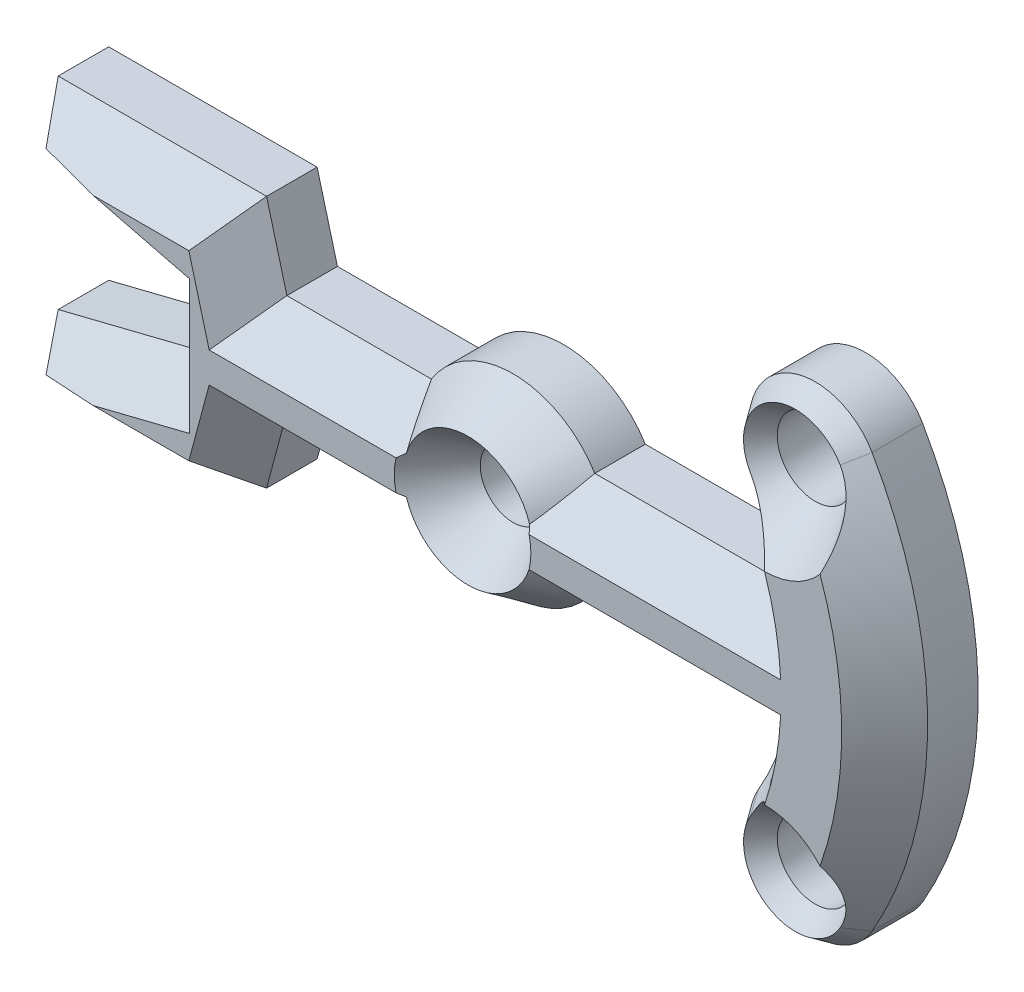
ISO-10303-21;
HEADER;
FILE_DESCRIPTION(('STEP AP214'),'2;1');
FILE_NAME('part.step','',(''),(''),'','','');
FILE_SCHEMA(('AUTOMOTIVE_DESIGN { 1 0 10303 214 1 1 1 1 }'));
ENDSEC;
DATA;
#1=APPLICATION_CONTEXT('core data for automotive mechanical design processes');
#2=APPLICATION_PROTOCOL_DEFINITION('international standard','automotive_design',2000,#1);
#3=PRODUCT_CONTEXT('',#1,'mechanical');
#4=PRODUCT('Part','Part','',(#3));
#5=PRODUCT_RELATED_PRODUCT_CATEGORY('part','',(#4));
#6=PRODUCT_DEFINITION_FORMATION('','',#4);
#7=PRODUCT_DEFINITION_CONTEXT('part definition',#1,'design');
#8=PRODUCT_DEFINITION('design','',#6,#7);
#9=PRODUCT_DEFINITION_SHAPE('','',#8);
#10=(LENGTH_UNIT() NAMED_UNIT(*) SI_UNIT(.MILLI.,.METRE.));
#11=(NAMED_UNIT(*) PLANE_ANGLE_UNIT() SI_UNIT($,.RADIAN.));
#12=(NAMED_UNIT(*) SI_UNIT($,.STERADIAN.) SOLID_ANGLE_UNIT());
#13=UNCERTAINTY_MEASURE_WITH_UNIT(LENGTH_MEASURE(1.E-05),#10,'distance_accuracy_value','');
#14=(GEOMETRIC_REPRESENTATION_CONTEXT(3) GLOBAL_UNCERTAINTY_ASSIGNED_CONTEXT((#13)) GLOBAL_UNIT_ASSIGNED_CONTEXT((#10,
#11,#12)) REPRESENTATION_CONTEXT('',''));
#15=CARTESIAN_POINT('',(0.,0.,0.));
#16=DIRECTION('',(0.,0.,1.));
#17=DIRECTION('',(1.,0.,0.));
#18=AXIS2_PLACEMENT_3D('',#15,#16,#17);
#19=CARTESIAN_POINT('',(0.,0.,-10.));
#20=DIRECTION('',(0.,0.,1.));
#21=DIRECTION('',(1.,0.,0.));
#22=AXIS2_PLACEMENT_3D('',#19,#20,#21);
#23=PLANE('',#22);
#24=CARTESIAN_POINT('',(59.7557528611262,34.5000000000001,-10.));
#25=DIRECTION('',(0.,0.,1.));
#26=DIRECTION('',(1.,0.,0.));
#27=AXIS2_PLACEMENT_3D('',#24,#25,#26);
#28=CIRCLE('',#27,7.50000000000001);
#29=CARTESIAN_POINT('',(67.2557528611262,34.5000000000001,-10.));
#30=VERTEX_POINT('',#29);
#31=EDGE_CURVE('E1103',#30,#30,#28,.T.);
#32=ORIENTED_EDGE('',*,*,#31,.T.);
#33=EDGE_LOOP('',(#32));
#34=FACE_BOUND('',#33,.T.);
#35=CARTESIAN_POINT('',(0.,0.,-10.));
#36=DIRECTION('',(0.,0.,1.));
#37=DIRECTION('',(1.,0.,0.));
#38=AXIS2_PLACEMENT_3D('',#35,#36,#37);
#39=CIRCLE('',#38,6.5);
#40=CARTESIAN_POINT('',(6.5,0.,-10.));
#41=VERTEX_POINT('',#40);
#42=EDGE_CURVE('E584',#41,#41,#39,.T.);
#43=ORIENTED_EDGE('',*,*,#42,.T.);
#44=EDGE_LOOP('',(#43));
#45=FACE_BOUND('',#44,.T.);
#46=CARTESIAN_POINT('',(0.,0.,-10.));
#47=DIRECTION('',(0.,0.,1.));
#48=DIRECTION('',(1.,0.,0.));
#49=AXIS2_PLACEMENT_3D('',#46,#47,#48);
#50=CIRCLE('',#49,19.);
#51=CARTESIAN_POINT('',(-16.1554944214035,-10.,-10.));
#52=VERTEX_POINT('',#51);
#53=CARTESIAN_POINT('',(16.1554944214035,-10.,-10.));
#54=VERTEX_POINT('',#53);
#55=EDGE_CURVE('E633',#52,#54,#50,.T.);
#56=ORIENTED_EDGE('',*,*,#55,.F.);
#57=DIRECTION('',(1.,0.,0.));
#58=VECTOR('',#57,1.);
#59=CARTESIAN_POINT('',(-44.753043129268,-10.,-10.));
#60=LINE('',#59,#58);
#61=CARTESIAN_POINT('',(-44.753043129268,-10.,-10.));
#62=VERTEX_POINT('',#61);
#63=EDGE_CURVE('E569',#62,#52,#60,.T.);
#64=ORIENTED_EDGE('',*,*,#63,.F.);
#65=DIRECTION('',(0.258819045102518,0.965925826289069,0.));
#66=VECTOR('',#65,1.);
#67=CARTESIAN_POINT('',(-48.7722810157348,-25.,-10.));
#68=LINE('',#67,#66);
#69=CARTESIAN_POINT('',(-48.7722810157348,-25.,-10.));
#70=VERTEX_POINT('',#69);
#71=EDGE_CURVE('E557',#70,#62,#68,.T.);
#72=ORIENTED_EDGE('',*,*,#71,.F.);
#73=DIRECTION('',(1.,0.,0.));
#74=VECTOR('',#73,1.);
#75=CARTESIAN_POINT('',(-90.,-25.,-10.));
#76=LINE('',#75,#74);
#77=CARTESIAN_POINT('',(-90.,-25.,-10.));
#78=VERTEX_POINT('',#77);
#79=EDGE_CURVE('E567',#78,#70,#76,.T.);
#80=ORIENTED_EDGE('',*,*,#79,.F.);
#81=DIRECTION('',(0.,1.,0.));
#82=VECTOR('',#81,1.);
#83=CARTESIAN_POINT('',(-90.,-25.,-10.));
#84=LINE('',#83,#82);
#85=CARTESIAN_POINT('',(-90.,-15.,-10.));
#86=VERTEX_POINT('',#85);
#87=EDGE_CURVE('E573',#78,#86,#84,.T.);
#88=ORIENTED_EDGE('',*,*,#87,.T.);
#89=DIRECTION('',(0.970295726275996,0.241921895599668,0.));
#90=VECTOR('',#89,1.);
#91=CARTESIAN_POINT('',(-90.,-15.,-10.));
#92=LINE('',#91,#90);
#93=CARTESIAN_POINT('',(-61.,-7.76948791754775,-10.));
#94=VERTEX_POINT('',#93);
#95=EDGE_CURVE('E575',#86,#94,#92,.T.);
#96=ORIENTED_EDGE('',*,*,#95,.T.);
#97=DIRECTION('',(0.,-1.,0.));
#98=VECTOR('',#97,1.);
#99=CARTESIAN_POINT('',(-61.,7.76948791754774,-10.));
#100=LINE('',#99,#98);
#101=CARTESIAN_POINT('',(-61.,7.76948791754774,-10.));
#102=VERTEX_POINT('',#101);
#103=EDGE_CURVE('E1141',#102,#94,#100,.T.);
#104=ORIENTED_EDGE('',*,*,#103,.F.);
#105=DIRECTION('',(0.970295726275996,-0.241921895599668,0.));
#106=VECTOR('',#105,1.);
#107=CARTESIAN_POINT('',(-90.,15.,-10.));
#108=LINE('',#107,#106);
#109=CARTESIAN_POINT('',(-90.,15.,-10.));
#110=VERTEX_POINT('',#109);
#111=EDGE_CURVE('E1138',#110,#102,#108,.T.);
#112=ORIENTED_EDGE('',*,*,#111,.F.);
#113=DIRECTION('',(0.,-1.,0.));
#114=VECTOR('',#113,1.);
#115=CARTESIAN_POINT('',(-90.,25.,-10.));
#116=LINE('',#115,#114);
#117=CARTESIAN_POINT('',(-90.,25.,-10.));
#118=VERTEX_POINT('',#117);
#119=EDGE_CURVE('E1135',#118,#110,#116,.T.);
#120=ORIENTED_EDGE('',*,*,#119,.F.);
#121=DIRECTION('',(1.,0.,0.));
#122=VECTOR('',#121,1.);
#123=CARTESIAN_POINT('',(-90.,25.,-10.));
#124=LINE('',#123,#122);
#125=CARTESIAN_POINT('',(-48.7722810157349,25.,-10.));
#126=VERTEX_POINT('',#125);
#127=EDGE_CURVE('E1133',#118,#126,#124,.T.);
#128=ORIENTED_EDGE('',*,*,#127,.T.);
#129=DIRECTION('',(0.258819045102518,-0.965925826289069,0.));
#130=VECTOR('',#129,1.);
#131=CARTESIAN_POINT('',(-48.7722810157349,25.,-10.));
#132=LINE('',#131,#130);
#133=CARTESIAN_POINT('',(-44.7530431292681,10.,-10.));
#134=VERTEX_POINT('',#133);
#135=EDGE_CURVE('E1131',#126,#134,#132,.T.);
#136=ORIENTED_EDGE('',*,*,#135,.T.);
#137=DIRECTION('',(1.,0.,0.));
#138=VECTOR('',#137,1.);
#139=CARTESIAN_POINT('',(-44.7530431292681,10.,-10.));
#140=LINE('',#139,#138);
#141=CARTESIAN_POINT('',(-16.1554944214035,10.,-10.));
#142=VERTEX_POINT('',#141);
#143=EDGE_CURVE('E1129',#134,#142,#140,.T.);
#144=ORIENTED_EDGE('',*,*,#143,.T.);
#145=CARTESIAN_POINT('',(0.,0.,-10.));
#146=DIRECTION('',(0.,0.,1.));
#147=DIRECTION('',(1.,0.,0.));
#148=AXIS2_PLACEMENT_3D('',#145,#146,#147);
#149=CIRCLE('',#148,19.);
#150=CARTESIAN_POINT('',(16.1554944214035,10.,-10.));
#151=VERTEX_POINT('',#150);
#152=EDGE_CURVE('E1126',#151,#142,#149,.T.);
#153=ORIENTED_EDGE('',*,*,#152,.F.);
#154=DIRECTION('',(1.,0.,0.));
#155=VECTOR('',#154,1.);
#156=CARTESIAN_POINT('',(16.1554944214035,10.,-10.));
#157=LINE('',#156,#155);
#158=CARTESIAN_POINT('',(55.0999092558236,10.,-10.));
#159=VERTEX_POINT('',#158);
#160=EDGE_CURVE('E1124',#151,#159,#157,.T.);
#161=ORIENTED_EDGE('',*,*,#160,.T.);
#162=CARTESIAN_POINT('',(0.,0.,-10.));
#163=DIRECTION('',(0.,0.,1.));
#164=DIRECTION('',(1.,0.,0.));
#165=AXIS2_PLACEMENT_3D('',#162,#163,#164);
#166=CIRCLE('',#165,56.);
#167=CARTESIAN_POINT('',(48.4974226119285,28.0000000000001,-10.));
#168=VERTEX_POINT('',#167);
#169=EDGE_CURVE('E1122',#159,#168,#166,.T.);
#170=ORIENTED_EDGE('',*,*,#169,.T.);
#171=CARTESIAN_POINT('',(59.7557528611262,34.5000000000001,-10.));
#172=DIRECTION('',(0.,0.,1.));
#173=DIRECTION('',(1.,0.,0.));
#174=AXIS2_PLACEMENT_3D('',#171,#172,#173);
#175=CIRCLE('',#174,13.);
#176=CARTESIAN_POINT('',(71.0140831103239,41.0000000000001,-10.));
#177=VERTEX_POINT('',#176);
#178=EDGE_CURVE('E1119',#177,#168,#175,.T.);
#179=ORIENTED_EDGE('',*,*,#178,.F.);
#180=CARTESIAN_POINT('',(0.,0.,-10.));
#181=DIRECTION('',(0.,0.,1.));
#182=DIRECTION('',(1.,0.,0.));
#183=AXIS2_PLACEMENT_3D('',#180,#181,#182);
#184=CIRCLE('',#183,82.);
#185=CARTESIAN_POINT('',(71.0140831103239,-41.0000000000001,-10.));
#186=VERTEX_POINT('',#185);
#187=EDGE_CURVE('E1116',#186,#177,#184,.T.);
#188=ORIENTED_EDGE('',*,*,#187,.F.);
#189=CARTESIAN_POINT('',(59.7557528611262,-34.5000000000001,-10.));
#190=DIRECTION('',(0.,0.,1.));
#191=DIRECTION('',(1.,0.,0.));
#192=AXIS2_PLACEMENT_3D('',#189,#190,#191);
#193=CIRCLE('',#192,13.);
#194=CARTESIAN_POINT('',(48.4974226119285,-28.0000000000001,-10.));
#195=VERTEX_POINT('',#194);
#196=EDGE_CURVE('E1113',#195,#186,#193,.T.);
#197=ORIENTED_EDGE('',*,*,#196,.F.);
#198=CARTESIAN_POINT('',(0.,0.,-10.));
#199=DIRECTION('',(0.,0.,1.));
#200=DIRECTION('',(1.,0.,0.));
#201=AXIS2_PLACEMENT_3D('',#198,#199,#200);
#202=CIRCLE('',#201,56.);
#203=CARTESIAN_POINT('',(55.0999092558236,-10.,-10.));
#204=VERTEX_POINT('',#203);
#205=EDGE_CURVE('E1111',#195,#204,#202,.T.);
#206=ORIENTED_EDGE('',*,*,#205,.T.);
#207=DIRECTION('',(1.,0.,0.));
#208=VECTOR('',#207,1.);
#209=CARTESIAN_POINT('',(16.1554944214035,-10.,-10.));
#210=LINE('',#209,#208);
#211=EDGE_CURVE('E1109',#54,#204,#210,.T.);
#212=ORIENTED_EDGE('',*,*,#211,.F.);
#213=EDGE_LOOP('',(#56,#64,#72,#80,#88,#96,#104,#112,#120,#128,#136,#144,#153,#161,#170,#179,
#188,#197,#206,#212));
#214=FACE_BOUND('',#213,.T.);
#215=CARTESIAN_POINT('',(59.7557528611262,-34.5000000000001,-10.));
#216=DIRECTION('',(0.,0.,-1.));
#217=DIRECTION('',(-1.,0.,0.));
#218=AXIS2_PLACEMENT_3D('',#215,#216,#217);
#219=CIRCLE('',#218,7.49999999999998);
#220=CARTESIAN_POINT('',(52.2557528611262,-34.5000000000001,-10.));
#221=VERTEX_POINT('',#220);
#222=EDGE_CURVE('E1100',#221,#221,#219,.T.);
#223=ORIENTED_EDGE('',*,*,#222,.F.);
#224=EDGE_LOOP('',(#223));
#225=FACE_BOUND('',#224,.T.);
#226=ADVANCED_FACE('F411',(#34,#45,#214,#225),#23,.F.);
#227=CARTESIAN_POINT('',(0.,0.,-10.));
#228=DIRECTION('',(0.,0.,1.));
#229=DIRECTION('',(1.,0.,0.));
#230=AXIS2_PLACEMENT_3D('',#227,#228,#229);
#231=CYLINDRICAL_SURFACE('',#230,19.);
#232=CARTESIAN_POINT('',(0.,0.,0.));
#233=DIRECTION('',(0.,0.,1.));
#234=DIRECTION('',(1.,0.,0.));
#235=AXIS2_PLACEMENT_3D('',#232,#233,#234);
#236=CIRCLE('',#235,19.);
#237=CARTESIAN_POINT('',(-16.1554944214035,-10.,0.));
#238=VERTEX_POINT('',#237);
#239=CARTESIAN_POINT('',(16.1554944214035,-10.,0.));
#240=VERTEX_POINT('',#239);
#241=EDGE_CURVE('E580',#238,#240,#236,.T.);
#242=ORIENTED_EDGE('',*,*,#241,.F.);
#243=DIRECTION('',(0.,0.,1.));
#244=VECTOR('',#243,1.);
#245=CARTESIAN_POINT('',(-16.1554944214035,-10.,-10.));
#246=LINE('',#245,#244);
#247=EDGE_CURVE('E12',#52,#238,#246,.T.);
#248=ORIENTED_EDGE('',*,*,#247,.F.);
#249=ORIENTED_EDGE('',*,*,#55,.T.);
#250=DIRECTION('',(0.,0.,1.));
#251=VECTOR('',#250,1.);
#252=CARTESIAN_POINT('',(16.1554944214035,-10.,-10.));
#253=LINE('',#252,#251);
#254=EDGE_CURVE('E415',#54,#240,#253,.T.);
#255=ORIENTED_EDGE('',*,*,#254,.T.);
#256=EDGE_LOOP('',(#242,#248,#249,#255));
#257=FACE_BOUND('',#256,.T.);
#258=ADVANCED_FACE('F413',(#257),#231,.T.);
#259=CARTESIAN_POINT('',(-44.753043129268,-10.,-10.));
#260=DIRECTION('',(0.,-1.,0.));
#261=DIRECTION('',(1.,0.,0.));
#262=AXIS2_PLACEMENT_3D('',#259,#260,#261);
#263=PLANE('',#262);
#264=DIRECTION('',(1.,0.,0.));
#265=VECTOR('',#264,1.);
#266=CARTESIAN_POINT('',(-44.753043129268,-10.,0.));
#267=LINE('',#266,#265);
#268=CARTESIAN_POINT('',(-44.753043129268,-10.,0.));
#269=VERTEX_POINT('',#268);
#270=EDGE_CURVE('E631',#269,#238,#267,.T.);
#271=ORIENTED_EDGE('',*,*,#270,.F.);
#272=DIRECTION('',(0.,0.,1.));
#273=VECTOR('',#272,1.);
#274=CARTESIAN_POINT('',(-44.753043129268,-10.,-10.));
#275=LINE('',#274,#273);
#276=EDGE_CURVE('E421',#62,#269,#275,.T.);
#277=ORIENTED_EDGE('',*,*,#276,.F.);
#278=ORIENTED_EDGE('',*,*,#63,.T.);
#279=ORIENTED_EDGE('',*,*,#247,.T.);
#280=EDGE_LOOP('',(#271,#277,#278,#279));
#281=FACE_BOUND('',#280,.T.);
#282=ADVANCED_FACE('F708',(#281),#263,.T.);
#283=CARTESIAN_POINT('',(-48.7722810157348,-25.,-10.));
#284=DIRECTION('',(0.965925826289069,-0.258819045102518,0.));
#285=DIRECTION('',(0.258819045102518,0.965925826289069,0.));
#286=AXIS2_PLACEMENT_3D('',#283,#284,#285);
#287=PLANE('',#286);
#288=DIRECTION('',(0.258819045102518,0.965925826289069,0.));
#289=VECTOR('',#288,1.);
#290=CARTESIAN_POINT('',(-48.7722810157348,-25.,0.));
#291=LINE('',#290,#289);
#292=CARTESIAN_POINT('',(-48.7722810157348,-25.,0.));
#293=VERTEX_POINT('',#292);
#294=EDGE_CURVE('E560',#293,#269,#291,.T.);
#295=ORIENTED_EDGE('',*,*,#294,.F.);
#296=DIRECTION('',(0.,0.,1.));
#297=VECTOR('',#296,1.);
#298=CARTESIAN_POINT('',(-48.7722810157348,-25.,-10.));
#299=LINE('',#298,#297);
#300=EDGE_CURVE('E492',#70,#293,#299,.T.);
#301=ORIENTED_EDGE('',*,*,#300,.F.);
#302=ORIENTED_EDGE('',*,*,#71,.T.);
#303=ORIENTED_EDGE('',*,*,#276,.T.);
#304=EDGE_LOOP('',(#295,#301,#302,#303));
#305=FACE_BOUND('',#304,.T.);
#306=ADVANCED_FACE('F556',(#305),#287,.T.);
#307=CARTESIAN_POINT('',(-90.,-25.,-10.));
#308=DIRECTION('',(0.,-1.,0.));
#309=DIRECTION('',(0.,0.,-1.));
#310=AXIS2_PLACEMENT_3D('',#307,#308,#309);
#311=PLANE('',#310);
#312=DIRECTION('',(1.,0.,0.));
#313=VECTOR('',#312,1.);
#314=CARTESIAN_POINT('',(-90.,-25.,0.));
#315=LINE('',#314,#313);
#316=CARTESIAN_POINT('',(-90.,-25.,0.));
#317=VERTEX_POINT('',#316);
#318=EDGE_CURVE('E628',#317,#293,#315,.T.);
#319=ORIENTED_EDGE('',*,*,#318,.F.);
#320=DIRECTION('',(0.,0.,1.));
#321=VECTOR('',#320,1.);
#322=CARTESIAN_POINT('',(-90.,-25.,-10.));
#323=LINE('',#322,#321);
#324=EDGE_CURVE('E562',#78,#317,#323,.T.);
#325=ORIENTED_EDGE('',*,*,#324,.F.);
#326=ORIENTED_EDGE('',*,*,#79,.T.);
#327=ORIENTED_EDGE('',*,*,#300,.T.);
#328=EDGE_LOOP('',(#319,#325,#326,#327));
#329=FACE_BOUND('',#328,.T.);
#330=ADVANCED_FACE('F571',(#329),#311,.T.);
#331=CARTESIAN_POINT('',(-90.,-25.,-10.));
#332=DIRECTION('',(1.,0.,0.));
#333=DIRECTION('',(0.,1.,0.));
#334=AXIS2_PLACEMENT_3D('',#331,#332,#333);
#335=PLANE('',#334);
#336=DIRECTION('',(0.,1.,0.));
#337=VECTOR('',#336,1.);
#338=CARTESIAN_POINT('',(-90.,-25.,0.));
#339=LINE('',#338,#337);
#340=CARTESIAN_POINT('',(-90.,-15.,0.));
#341=VERTEX_POINT('',#340);
#342=EDGE_CURVE('E626',#317,#341,#339,.T.);
#343=ORIENTED_EDGE('',*,*,#342,.T.);
#344=DIRECTION('',(0.,0.,1.));
#345=VECTOR('',#344,1.);
#346=CARTESIAN_POINT('',(-90.,-15.,-10.));
#347=LINE('',#346,#345);
#348=EDGE_CURVE('E637',#86,#341,#347,.T.);
#349=ORIENTED_EDGE('',*,*,#348,.F.);
#350=ORIENTED_EDGE('',*,*,#87,.F.);
#351=ORIENTED_EDGE('',*,*,#324,.T.);
#352=EDGE_LOOP('',(#343,#349,#350,#351));
#353=FACE_BOUND('',#352,.T.);
#354=ADVANCED_FACE('F983',(#353),#335,.F.);
#355=CARTESIAN_POINT('',(-90.,-15.,-10.));
#356=DIRECTION('',(0.241921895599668,-0.970295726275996,0.));
#357=DIRECTION('',(0.970295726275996,0.241921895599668,0.));
#358=AXIS2_PLACEMENT_3D('',#355,#356,#357);
#359=PLANE('',#358);
#360=DIRECTION('',(0.970295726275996,0.241921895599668,0.));
#361=VECTOR('',#360,1.);
#362=CARTESIAN_POINT('',(-90.,-15.,0.));
#363=LINE('',#362,#361);
#364=CARTESIAN_POINT('',(-61.,-7.76948791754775,0.));
#365=VERTEX_POINT('',#364);
#366=EDGE_CURVE('E623',#341,#365,#363,.T.);
#367=ORIENTED_EDGE('',*,*,#366,.T.);
#368=DIRECTION('',(0.,0.,1.));
#369=VECTOR('',#368,1.);
#370=CARTESIAN_POINT('',(-61.,-7.76948791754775,-10.));
#371=LINE('',#370,#369);
#372=EDGE_CURVE('E640',#94,#365,#371,.T.);
#373=ORIENTED_EDGE('',*,*,#372,.F.);
#374=ORIENTED_EDGE('',*,*,#95,.F.);
#375=ORIENTED_EDGE('',*,*,#348,.T.);
#376=EDGE_LOOP('',(#367,#373,#374,#375));
#377=FACE_BOUND('',#376,.T.);
#378=ADVANCED_FACE('F986',(#377),#359,.F.);
#379=CARTESIAN_POINT('',(-61.,7.76948791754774,-10.));
#380=DIRECTION('',(-1.,0.,0.));
#381=DIRECTION('',(0.,-1.,0.));
#382=AXIS2_PLACEMENT_3D('',#379,#380,#381);
#383=PLANE('',#382);
#384=DIRECTION('',(0.,-1.,0.));
#385=VECTOR('',#384,1.);
#386=CARTESIAN_POINT('',(-61.,7.76948791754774,0.));
#387=LINE('',#386,#385);
#388=CARTESIAN_POINT('',(-61.,7.76948791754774,0.));
#389=VERTEX_POINT('',#388);
#390=EDGE_CURVE('E620',#389,#365,#387,.T.);
#391=ORIENTED_EDGE('',*,*,#390,.F.);
#392=DIRECTION('',(0.,0.,1.));
#393=VECTOR('',#392,1.);
#394=CARTESIAN_POINT('',(-61.,7.76948791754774,-10.));
#395=LINE('',#394,#393);
#396=EDGE_CURVE('E642',#102,#389,#395,.T.);
#397=ORIENTED_EDGE('',*,*,#396,.F.);
#398=ORIENTED_EDGE('',*,*,#103,.T.);
#399=ORIENTED_EDGE('',*,*,#372,.T.);
#400=EDGE_LOOP('',(#391,#397,#398,#399));
#401=FACE_BOUND('',#400,.T.);
#402=ADVANCED_FACE('F990',(#401),#383,.T.);
#403=CARTESIAN_POINT('',(-90.,15.,-10.));
#404=DIRECTION('',(-0.241921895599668,-0.970295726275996,0.));
#405=DIRECTION('',(0.970295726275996,-0.241921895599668,0.));
#406=AXIS2_PLACEMENT_3D('',#403,#404,#405);
#407=PLANE('',#406);
#408=DIRECTION('',(0.970295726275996,-0.241921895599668,0.));
#409=VECTOR('',#408,1.);
#410=CARTESIAN_POINT('',(-90.,15.,0.));
#411=LINE('',#410,#409);
#412=CARTESIAN_POINT('',(-90.,15.,0.));
#413=VERTEX_POINT('',#412);
#414=EDGE_CURVE('E617',#413,#389,#411,.T.);
#415=ORIENTED_EDGE('',*,*,#414,.F.);
#416=DIRECTION('',(0.,0.,1.));
#417=VECTOR('',#416,1.);
#418=CARTESIAN_POINT('',(-90.,15.,-10.));
#419=LINE('',#418,#417);
#420=EDGE_CURVE('E644',#110,#413,#419,.T.);
#421=ORIENTED_EDGE('',*,*,#420,.F.);
#422=ORIENTED_EDGE('',*,*,#111,.T.);
#423=ORIENTED_EDGE('',*,*,#396,.T.);
#424=EDGE_LOOP('',(#415,#421,#422,#423));
#425=FACE_BOUND('',#424,.T.);
#426=ADVANCED_FACE('F994',(#425),#407,.T.);
#427=CARTESIAN_POINT('',(-90.,25.,-10.));
#428=DIRECTION('',(-1.,0.,0.));
#429=DIRECTION('',(0.,0.,1.));
#430=AXIS2_PLACEMENT_3D('',#427,#428,#429);
#431=PLANE('',#430);
#432=DIRECTION('',(0.,-1.,0.));
#433=VECTOR('',#432,1.);
#434=CARTESIAN_POINT('',(-90.,25.,0.));
#435=LINE('',#434,#433);
#436=CARTESIAN_POINT('',(-90.,25.,0.));
#437=VERTEX_POINT('',#436);
#438=EDGE_CURVE('E614',#437,#413,#435,.T.);
#439=ORIENTED_EDGE('',*,*,#438,.F.);
#440=DIRECTION('',(0.,0.,1.));
#441=VECTOR('',#440,1.);
#442=CARTESIAN_POINT('',(-90.,25.,-10.));
#443=LINE('',#442,#441);
#444=EDGE_CURVE('E646',#118,#437,#443,.T.);
#445=ORIENTED_EDGE('',*,*,#444,.F.);
#446=ORIENTED_EDGE('',*,*,#119,.T.);
#447=ORIENTED_EDGE('',*,*,#420,.T.);
#448=EDGE_LOOP('',(#439,#445,#446,#447));
#449=FACE_BOUND('',#448,.T.);
#450=ADVANCED_FACE('F998',(#449),#431,.T.);
#451=CARTESIAN_POINT('',(-90.,25.,-10.));
#452=DIRECTION('',(0.,-1.,0.));
#453=DIRECTION('',(0.,0.,-1.));
#454=AXIS2_PLACEMENT_3D('',#451,#452,#453);
#455=PLANE('',#454);
#456=DIRECTION('',(1.,0.,0.));
#457=VECTOR('',#456,1.);
#458=CARTESIAN_POINT('',(-90.,25.,0.));
#459=LINE('',#458,#457);
#460=CARTESIAN_POINT('',(-48.7722810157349,25.,0.));
#461=VERTEX_POINT('',#460);
#462=EDGE_CURVE('E612',#437,#461,#459,.T.);
#463=ORIENTED_EDGE('',*,*,#462,.T.);
#464=DIRECTION('',(0.,0.,1.));
#465=VECTOR('',#464,1.);
#466=CARTESIAN_POINT('',(-48.7722810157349,25.,-10.));
#467=LINE('',#466,#465);
#468=EDGE_CURVE('E648',#126,#461,#467,.T.);
#469=ORIENTED_EDGE('',*,*,#468,.F.);
#470=ORIENTED_EDGE('',*,*,#127,.F.);
#471=ORIENTED_EDGE('',*,*,#444,.T.);
#472=EDGE_LOOP('',(#463,#469,#470,#471));
#473=FACE_BOUND('',#472,.T.);
#474=ADVANCED_FACE('F1002',(#473),#455,.F.);
#475=CARTESIAN_POINT('',(-48.7722810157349,25.,-10.));
#476=DIRECTION('',(-0.965925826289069,-0.258819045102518,0.));
#477=DIRECTION('',(0.258819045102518,-0.965925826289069,0.));
#478=AXIS2_PLACEMENT_3D('',#475,#476,#477);
#479=PLANE('',#478);
#480=DIRECTION('',(0.258819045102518,-0.965925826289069,0.));
#481=VECTOR('',#480,1.);
#482=CARTESIAN_POINT('',(-48.7722810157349,25.,0.));
#483=LINE('',#482,#481);
#484=CARTESIAN_POINT('',(-44.7530431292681,10.,0.));
#485=VERTEX_POINT('',#484);
#486=EDGE_CURVE('E610',#461,#485,#483,.T.);
#487=ORIENTED_EDGE('',*,*,#486,.T.);
#488=DIRECTION('',(0.,0.,1.));
#489=VECTOR('',#488,1.);
#490=CARTESIAN_POINT('',(-44.7530431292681,10.,-10.));
#491=LINE('',#490,#489);
#492=EDGE_CURVE('E651',#134,#485,#491,.T.);
#493=ORIENTED_EDGE('',*,*,#492,.F.);
#494=ORIENTED_EDGE('',*,*,#135,.F.);
#495=ORIENTED_EDGE('',*,*,#468,.T.);
#496=EDGE_LOOP('',(#487,#493,#494,#495));
#497=FACE_BOUND('',#496,.T.);
#498=ADVANCED_FACE('F1006',(#497),#479,.F.);
#499=CARTESIAN_POINT('',(-44.7530431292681,10.,-10.));
#500=DIRECTION('',(0.,-1.,0.));
#501=DIRECTION('',(1.,0.,0.));
#502=AXIS2_PLACEMENT_3D('',#499,#500,#501);
#503=PLANE('',#502);
#504=DIRECTION('',(1.,0.,0.));
#505=VECTOR('',#504,1.);
#506=CARTESIAN_POINT('',(-44.7530431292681,10.,0.));
#507=LINE('',#506,#505);
#508=CARTESIAN_POINT('',(-16.1554944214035,10.,0.));
#509=VERTEX_POINT('',#508);
#510=EDGE_CURVE('E607',#485,#509,#507,.T.);
#511=ORIENTED_EDGE('',*,*,#510,.T.);
#512=DIRECTION('',(0.,0.,1.));
#513=VECTOR('',#512,1.);
#514=CARTESIAN_POINT('',(-16.1554944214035,10.,-10.));
#515=LINE('',#514,#513);
#516=EDGE_CURVE('E654',#142,#509,#515,.T.);
#517=ORIENTED_EDGE('',*,*,#516,.F.);
#518=ORIENTED_EDGE('',*,*,#143,.F.);
#519=ORIENTED_EDGE('',*,*,#492,.T.);
#520=EDGE_LOOP('',(#511,#517,#518,#519));
#521=FACE_BOUND('',#520,.T.);
#522=ADVANCED_FACE('F1010',(#521),#503,.F.);
#523=CARTESIAN_POINT('',(0.,0.,-10.));
#524=DIRECTION('',(0.,0.,1.));
#525=DIRECTION('',(1.,0.,0.));
#526=AXIS2_PLACEMENT_3D('',#523,#524,#525);
#527=CYLINDRICAL_SURFACE('',#526,19.);
#528=CARTESIAN_POINT('',(0.,0.,0.));
#529=DIRECTION('',(0.,0.,1.));
#530=DIRECTION('',(1.,0.,0.));
#531=AXIS2_PLACEMENT_3D('',#528,#529,#530);
#532=CIRCLE('',#531,19.);
#533=CARTESIAN_POINT('',(16.1554944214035,10.,0.));
#534=VERTEX_POINT('',#533);
#535=EDGE_CURVE('E604',#534,#509,#532,.T.);
#536=ORIENTED_EDGE('',*,*,#535,.F.);
#537=DIRECTION('',(0.,0.,1.));
#538=VECTOR('',#537,1.);
#539=CARTESIAN_POINT('',(16.1554944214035,10.,-10.));
#540=LINE('',#539,#538);
#541=EDGE_CURVE('E656',#151,#534,#540,.T.);
#542=ORIENTED_EDGE('',*,*,#541,.F.);
#543=ORIENTED_EDGE('',*,*,#152,.T.);
#544=ORIENTED_EDGE('',*,*,#516,.T.);
#545=EDGE_LOOP('',(#536,#542,#543,#544));
#546=FACE_BOUND('',#545,.T.);
#547=ADVANCED_FACE('F1014',(#546),#527,.T.);
#548=CARTESIAN_POINT('',(16.1554944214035,10.,-10.));
#549=DIRECTION('',(0.,-1.,0.));
#550=DIRECTION('',(0.,0.,-1.));
#551=AXIS2_PLACEMENT_3D('',#548,#549,#550);
#552=PLANE('',#551);
#553=DIRECTION('',(1.,0.,0.));
#554=VECTOR('',#553,1.);
#555=CARTESIAN_POINT('',(16.1554944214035,10.,0.));
#556=LINE('',#555,#554);
#557=CARTESIAN_POINT('',(55.0999092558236,10.,0.));
#558=VERTEX_POINT('',#557);
#559=EDGE_CURVE('E602',#534,#558,#556,.T.);
#560=ORIENTED_EDGE('',*,*,#559,.T.);
#561=DIRECTION('',(0.,0.,1.));
#562=VECTOR('',#561,1.);
#563=CARTESIAN_POINT('',(55.0999092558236,10.,-10.));
#564=LINE('',#563,#562);
#565=EDGE_CURVE('E658',#159,#558,#564,.T.);
#566=ORIENTED_EDGE('',*,*,#565,.F.);
#567=ORIENTED_EDGE('',*,*,#160,.F.);
#568=ORIENTED_EDGE('',*,*,#541,.T.);
#569=EDGE_LOOP('',(#560,#566,#567,#568));
#570=FACE_BOUND('',#569,.T.);
#571=ADVANCED_FACE('F1018',(#570),#552,.F.);
#572=CARTESIAN_POINT('',(0.,0.,-10.));
#573=DIRECTION('',(0.,0.,1.));
#574=DIRECTION('',(1.,0.,0.));
#575=AXIS2_PLACEMENT_3D('',#572,#573,#574);
#576=CYLINDRICAL_SURFACE('',#575,56.);
#577=CARTESIAN_POINT('',(0.,0.,0.));
#578=DIRECTION('',(0.,0.,1.));
#579=DIRECTION('',(1.,0.,0.));
#580=AXIS2_PLACEMENT_3D('',#577,#578,#579);
#581=CIRCLE('',#580,56.);
#582=CARTESIAN_POINT('',(48.4974226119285,28.0000000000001,0.));
#583=VERTEX_POINT('',#582);
#584=EDGE_CURVE('E599',#558,#583,#581,.T.);
#585=ORIENTED_EDGE('',*,*,#584,.T.);
#586=DIRECTION('',(0.,0.,1.));
#587=VECTOR('',#586,1.);
#588=CARTESIAN_POINT('',(48.4974226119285,28.0000000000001,-10.));
#589=LINE('',#588,#587);
#590=EDGE_CURVE('E661',#168,#583,#589,.T.);
#591=ORIENTED_EDGE('',*,*,#590,.F.);
#592=ORIENTED_EDGE('',*,*,#169,.F.);
#593=ORIENTED_EDGE('',*,*,#565,.T.);
#594=EDGE_LOOP('',(#585,#591,#592,#593));
#595=FACE_BOUND('',#594,.T.);
#596=ADVANCED_FACE('F1022',(#595),#576,.F.);
#597=CARTESIAN_POINT('',(59.7557528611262,34.5000000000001,-10.));
#598=DIRECTION('',(0.,0.,1.));
#599=DIRECTION('',(1.,0.,0.));
#600=AXIS2_PLACEMENT_3D('',#597,#598,#599);
#601=CYLINDRICAL_SURFACE('',#600,13.);
#602=CARTESIAN_POINT('',(59.7557528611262,34.5000000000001,0.));
#603=DIRECTION('',(0.,0.,1.));
#604=DIRECTION('',(1.,0.,0.));
#605=AXIS2_PLACEMENT_3D('',#602,#603,#604);
#606=CIRCLE('',#605,13.);
#607=CARTESIAN_POINT('',(71.0140831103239,41.0000000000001,0.));
#608=VERTEX_POINT('',#607);
#609=EDGE_CURVE('E596',#608,#583,#606,.T.);
#610=ORIENTED_EDGE('',*,*,#609,.F.);
#611=DIRECTION('',(0.,0.,1.));
#612=VECTOR('',#611,1.);
#613=CARTESIAN_POINT('',(71.0140831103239,41.0000000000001,-10.));
#614=LINE('',#613,#612);
#615=EDGE_CURVE('E663',#177,#608,#614,.T.);
#616=ORIENTED_EDGE('',*,*,#615,.F.);
#617=ORIENTED_EDGE('',*,*,#178,.T.);
#618=ORIENTED_EDGE('',*,*,#590,.T.);
#619=EDGE_LOOP('',(#610,#616,#617,#618));
#620=FACE_BOUND('',#619,.T.);
#621=ADVANCED_FACE('F1026',(#620),#601,.T.);
#622=CARTESIAN_POINT('',(0.,0.,-10.));
#623=DIRECTION('',(0.,0.,1.));
#624=DIRECTION('',(1.,0.,0.));
#625=AXIS2_PLACEMENT_3D('',#622,#623,#624);
#626=CYLINDRICAL_SURFACE('',#625,82.);
#627=CARTESIAN_POINT('',(0.,0.,0.));
#628=DIRECTION('',(0.,0.,1.));
#629=DIRECTION('',(1.,0.,0.));
#630=AXIS2_PLACEMENT_3D('',#627,#628,#629);
#631=CIRCLE('',#630,82.);
#632=CARTESIAN_POINT('',(71.0140831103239,-41.0000000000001,0.));
#633=VERTEX_POINT('',#632);
#634=EDGE_CURVE('E593',#633,#608,#631,.T.);
#635=ORIENTED_EDGE('',*,*,#634,.F.);
#636=DIRECTION('',(0.,0.,1.));
#637=VECTOR('',#636,1.);
#638=CARTESIAN_POINT('',(71.0140831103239,-41.0000000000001,-10.));
#639=LINE('',#638,#637);
#640=EDGE_CURVE('E665',#186,#633,#639,.T.);
#641=ORIENTED_EDGE('',*,*,#640,.F.);
#642=ORIENTED_EDGE('',*,*,#187,.T.);
#643=ORIENTED_EDGE('',*,*,#615,.T.);
#644=EDGE_LOOP('',(#635,#641,#642,#643));
#645=FACE_BOUND('',#644,.T.);
#646=ADVANCED_FACE('F1030',(#645),#626,.T.);
#647=CARTESIAN_POINT('',(59.7557528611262,-34.5000000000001,-10.));
#648=DIRECTION('',(0.,0.,1.));
#649=DIRECTION('',(1.,0.,0.));
#650=AXIS2_PLACEMENT_3D('',#647,#648,#649);
#651=CYLINDRICAL_SURFACE('',#650,13.);
#652=CARTESIAN_POINT('',(59.7557528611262,-34.5000000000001,0.));
#653=DIRECTION('',(0.,0.,1.));
#654=DIRECTION('',(1.,0.,0.));
#655=AXIS2_PLACEMENT_3D('',#652,#653,#654);
#656=CIRCLE('',#655,13.);
#657=CARTESIAN_POINT('',(48.4974226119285,-28.0000000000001,0.));
#658=VERTEX_POINT('',#657);
#659=EDGE_CURVE('E590',#658,#633,#656,.T.);
#660=ORIENTED_EDGE('',*,*,#659,.F.);
#661=DIRECTION('',(0.,0.,1.));
#662=VECTOR('',#661,1.);
#663=CARTESIAN_POINT('',(48.4974226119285,-28.0000000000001,-10.));
#664=LINE('',#663,#662);
#665=EDGE_CURVE('E667',#195,#658,#664,.T.);
#666=ORIENTED_EDGE('',*,*,#665,.F.);
#667=ORIENTED_EDGE('',*,*,#196,.T.);
#668=ORIENTED_EDGE('',*,*,#640,.T.);
#669=EDGE_LOOP('',(#660,#666,#667,#668));
#670=FACE_BOUND('',#669,.T.);
#671=ADVANCED_FACE('F1034',(#670),#651,.T.);
#672=CARTESIAN_POINT('',(0.,0.,-10.));
#673=DIRECTION('',(0.,0.,1.));
#674=DIRECTION('',(1.,0.,0.));
#675=AXIS2_PLACEMENT_3D('',#672,#673,#674);
#676=CYLINDRICAL_SURFACE('',#675,56.);
#677=CARTESIAN_POINT('',(0.,0.,0.));
#678=DIRECTION('',(0.,0.,1.));
#679=DIRECTION('',(1.,0.,0.));
#680=AXIS2_PLACEMENT_3D('',#677,#678,#679);
#681=CIRCLE('',#680,56.);
#682=CARTESIAN_POINT('',(55.0999092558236,-10.,0.));
#683=VERTEX_POINT('',#682);
#684=EDGE_CURVE('E587',#658,#683,#681,.T.);
#685=ORIENTED_EDGE('',*,*,#684,.T.);
#686=DIRECTION('',(0.,0.,1.));
#687=VECTOR('',#686,1.);
#688=CARTESIAN_POINT('',(55.0999092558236,-10.,-10.));
#689=LINE('',#688,#687);
#690=EDGE_CURVE('E668',#204,#683,#689,.T.);
#691=ORIENTED_EDGE('',*,*,#690,.F.);
#692=ORIENTED_EDGE('',*,*,#205,.F.);
#693=ORIENTED_EDGE('',*,*,#665,.T.);
#694=EDGE_LOOP('',(#685,#691,#692,#693));
#695=FACE_BOUND('',#694,.T.);
#696=ADVANCED_FACE('F1038',(#695),#676,.F.);
#697=CARTESIAN_POINT('',(16.1554944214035,-10.,-10.));
#698=DIRECTION('',(0.,-1.,0.));
#699=DIRECTION('',(0.,0.,-1.));
#700=AXIS2_PLACEMENT_3D('',#697,#698,#699);
#701=PLANE('',#700);
#702=DIRECTION('',(1.,0.,0.));
#703=VECTOR('',#702,1.);
#704=CARTESIAN_POINT('',(16.1554944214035,-10.,0.));
#705=LINE('',#704,#703);
#706=EDGE_CURVE('E583',#240,#683,#705,.T.);
#707=ORIENTED_EDGE('',*,*,#706,.F.);
#708=ORIENTED_EDGE('',*,*,#254,.F.);
#709=ORIENTED_EDGE('',*,*,#211,.T.);
#710=ORIENTED_EDGE('',*,*,#690,.T.);
#711=EDGE_LOOP('',(#707,#708,#709,#710));
#712=FACE_BOUND('',#711,.T.);
#713=ADVANCED_FACE('F672',(#712),#701,.T.);
#714=CARTESIAN_POINT('',(0.,0.,-10.));
#715=DIRECTION('',(0.,0.,1.));
#716=DIRECTION('',(1.,0.,0.));
#717=AXIS2_PLACEMENT_3D('',#714,#715,#716);
#718=CYLINDRICAL_SURFACE('',#717,6.5);
#719=ORIENTED_EDGE('',*,*,#42,.F.);
#720=EDGE_LOOP('',(#719));
#721=FACE_BOUND('',#720,.T.);
#722=CARTESIAN_POINT('',(0.,0.,0.));
#723=DIRECTION('',(0.,0.,1.));
#724=DIRECTION('',(1.,0.,0.));
#725=AXIS2_PLACEMENT_3D('',#722,#723,#724);
#726=CIRCLE('',#725,6.5);
#727=CARTESIAN_POINT('',(6.5,0.,0.));
#728=VERTEX_POINT('',#727);
#729=EDGE_CURVE('E1057',#728,#728,#726,.T.);
#730=ORIENTED_EDGE('',*,*,#729,.T.);
#731=EDGE_LOOP('',(#730));
#732=FACE_BOUND('',#731,.T.);
#733=ADVANCED_FACE('F975',(#721,#732),#718,.F.);
#734=CARTESIAN_POINT('',(59.7557528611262,34.5000000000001,-10.));
#735=DIRECTION('',(0.,0.,1.));
#736=DIRECTION('',(1.,0.,0.));
#737=AXIS2_PLACEMENT_3D('',#734,#735,#736);
#738=CYLINDRICAL_SURFACE('',#737,7.50000000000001);
#739=ORIENTED_EDGE('',*,*,#31,.F.);
#740=EDGE_LOOP('',(#739));
#741=FACE_BOUND('',#740,.T.);
#742=CARTESIAN_POINT('',(59.7557528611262,34.5000000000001,0.));
#743=DIRECTION('',(0.,0.,1.));
#744=DIRECTION('',(1.,0.,0.));
#745=AXIS2_PLACEMENT_3D('',#742,#743,#744);
#746=CIRCLE('',#745,7.50000000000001);
#747=CARTESIAN_POINT('',(67.2557528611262,34.5000000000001,0.));
#748=VERTEX_POINT('',#747);
#749=EDGE_CURVE('E1063',#748,#748,#746,.T.);
#750=ORIENTED_EDGE('',*,*,#749,.T.);
#751=EDGE_LOOP('',(#750));
#752=FACE_BOUND('',#751,.T.);
#753=ADVANCED_FACE('F1046',(#741,#752),#738,.F.);
#754=CARTESIAN_POINT('',(59.7557528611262,-34.5000000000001,-10.));
#755=DIRECTION('',(0.,0.,1.));
#756=DIRECTION('',(1.,0.,0.));
#757=AXIS2_PLACEMENT_3D('',#754,#755,#756);
#758=CYLINDRICAL_SURFACE('',#757,7.49999999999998);
#759=ORIENTED_EDGE('',*,*,#222,.T.);
#760=EDGE_LOOP('',(#759));
#761=FACE_BOUND('',#760,.T.);
#762=CARTESIAN_POINT('',(59.7557528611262,-34.5000000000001,0.));
#763=DIRECTION('',(0.,0.,-1.));
#764=DIRECTION('',(-1.,0.,0.));
#765=AXIS2_PLACEMENT_3D('',#762,#763,#764);
#766=CIRCLE('',#765,7.49999999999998);
#767=CARTESIAN_POINT('',(52.2557528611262,-34.5000000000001,0.));
#768=VERTEX_POINT('',#767);
#769=EDGE_CURVE('E1099',#768,#768,#766,.T.);
#770=ORIENTED_EDGE('',*,*,#769,.F.);
#771=EDGE_LOOP('',(#770));
#772=FACE_BOUND('',#771,.T.);
#773=ADVANCED_FACE('F853',(#761,#772),#758,.F.);
#774=CARTESIAN_POINT('',(0.,0.,0.));
#775=DIRECTION('',(0.,0.,1.));
#776=DIRECTION('',(1.,0.,0.));
#777=AXIS2_PLACEMENT_3D('',#774,#775,#776);
#778=CONICAL_SURFACE('',#777,6.5,0.610865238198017);
#779=ORIENTED_EDGE('',*,*,#729,.F.);
#780=EDGE_LOOP('',(#779));
#781=FACE_BOUND('',#780,.T.);
#782=CARTESIAN_POINT('',(-7.29328845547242,-6.63811950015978,4.80126293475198));
#783=CARTESIAN_POINT('',(-7.43754349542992,-6.57435386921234,4.89232969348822));
#784=CARTESIAN_POINT('',(-7.58019581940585,-6.50940989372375,4.98507930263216));
#785=CARTESIAN_POINT('',(-7.86239313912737,-6.37735444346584,5.17367403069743));
#786=CARTESIAN_POINT('',(-8.00193847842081,-6.31024321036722,5.26951880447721));
#787=CARTESIAN_POINT('',(-8.41592292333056,-6.10601230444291,5.56119076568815));
#788=CARTESIAN_POINT('',(-8.68590421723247,-5.96590914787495,5.76127880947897));
#789=CARTESIAN_POINT('',(-9.21405725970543,-5.67941478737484,6.17043515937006));
#790=CARTESIAN_POINT('',(-9.47225936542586,-5.53304188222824,6.37947733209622));
#791=CARTESIAN_POINT('',(-9.97856130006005,-5.23461835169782,6.80567030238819));
#792=CARTESIAN_POINT('',(-10.226659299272,-5.08256670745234,7.02282255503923));
#793=CARTESIAN_POINT('',(-10.7110255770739,-4.77521144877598,7.46177135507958));
#794=CARTESIAN_POINT('',(-10.9473888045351,-4.61995691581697,7.68349780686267));
#795=CARTESIAN_POINT('',(-11.4117126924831,-4.30535490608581,8.13279603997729));
#796=CARTESIAN_POINT('',(-11.6396726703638,-4.14600709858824,8.36036829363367));
#797=CARTESIAN_POINT('',(-12.0880016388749,-3.82365156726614,8.82073970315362));
#798=CARTESIAN_POINT('',(-12.3083649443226,-3.66064124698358,9.05354256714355));
#799=CARTESIAN_POINT('',(-12.7419361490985,-3.33151655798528,9.52358133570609));
#800=CARTESIAN_POINT('',(-12.9551437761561,-3.16540207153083,9.76081740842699));
#801=CARTESIAN_POINT('',(-13.4650829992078,-2.75853392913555,10.3418853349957));
#802=CARTESIAN_POINT('',(-13.7583685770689,-2.51635848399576,10.687747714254));
#803=CARTESIAN_POINT('',(-14.3328441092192,-2.0273349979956,11.3861456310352));
#804=CARTESIAN_POINT('',(-14.614033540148,-1.78048675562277,11.7386814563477));
#805=CARTESIAN_POINT('',(-15.1655230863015,-1.28281638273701,12.4494284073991));
#806=CARTESIAN_POINT('',(-15.4358228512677,-1.03199412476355,12.8076397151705));
#807=CARTESIAN_POINT('',(-15.966568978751,-0.526942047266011,13.5289288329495));
#808=CARTESIAN_POINT('',(-16.2270151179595,-0.272712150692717,13.8920067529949));
#809=CARTESIAN_POINT('',(-16.742710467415,0.24245140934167,14.6277365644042));
#810=CARTESIAN_POINT('',(-16.9978270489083,0.503428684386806,15.0004507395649));
#811=CARTESIAN_POINT('',(-17.4996568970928,1.02803190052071,15.7496617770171));
#812=CARTESIAN_POINT('',(-17.7463699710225,1.29165790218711,16.1261587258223));
#813=CARTESIAN_POINT('',(-18.2318724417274,1.82097735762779,16.8821052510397));
#814=CARTESIAN_POINT('',(-18.4706691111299,2.08666862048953,17.2615516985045));
#815=CARTESIAN_POINT('',(-18.9411691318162,2.62008351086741,18.0233471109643));
#816=CARTESIAN_POINT('',(-19.1728730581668,2.88780697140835,18.4056958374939));
#817=CARTESIAN_POINT('',(-19.401343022,3.15642760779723,18.7893258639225));
#818=B_SPLINE_CURVE_WITH_KNOTS('',3,(#782,#783,#784,#785,#786,#787,#788,#789,#790,#791,#792,
#793,#794,#795,#796,#797,#798,#799,#800,#801,#802,#803,#804,#805,#806,#807,#808,#809,#810,#811,
#812,#813,#814,#815,#816,#817),.UNSPECIFIED.,.F.,.F.,(4,2,2,2,2,2,2,2,2,2,2,2,2,2,2,2,2,4),(0.,
0.546324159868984,1.09258760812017,2.18437951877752,3.27317718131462,4.3621711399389,
5.44004161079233,6.51799944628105,7.59674722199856,8.6755359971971,10.2175464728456,
11.7596235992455,13.3017502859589,14.8439119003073,16.4087377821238,17.9735995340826,
19.5369814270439,21.1002362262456),.UNSPECIFIED.);
#819=CARTESIAN_POINT('',(-12.1860576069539,-3.75,8.92592504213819));
#820=VERTEX_POINT('',#819);
#821=CARTESIAN_POINT('',(-13.1650479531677,-2.99792461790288,10.));
#822=VERTEX_POINT('',#821);
#823=EDGE_CURVE('E836',#820,#822,#818,.T.);
#824=ORIENTED_EDGE('',*,*,#823,.F.);
#825=CARTESIAN_POINT('',(0.,0.,8.92592504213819));
#826=DIRECTION('',(0.,0.,1.));
#827=DIRECTION('',(1.,0.,0.));
#828=AXIS2_PLACEMENT_3D('',#825,#826,#827);
#829=CIRCLE('',#828,12.75);
#830=CARTESIAN_POINT('',(12.1860576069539,-3.74999999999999,8.92592504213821));
#831=VERTEX_POINT('',#830);
#832=EDGE_CURVE('E694',#820,#831,#829,.T.);
#833=ORIENTED_EDGE('',*,*,#832,.T.);
#834=CARTESIAN_POINT('',(7.29328845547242,-6.63811950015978,4.80126293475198));
#835=CARTESIAN_POINT('',(7.43754349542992,-6.57435386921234,4.89232969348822));
#836=CARTESIAN_POINT('',(7.58019581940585,-6.50940989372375,4.98507930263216));
#837=CARTESIAN_POINT('',(7.86239313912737,-6.37735444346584,5.17367403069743));
#838=CARTESIAN_POINT('',(8.00193847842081,-6.31024321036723,5.26951880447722));
#839=CARTESIAN_POINT('',(8.41592292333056,-6.10601230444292,5.56119076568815));
#840=CARTESIAN_POINT('',(8.68590421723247,-5.96590914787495,5.76127880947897));
#841=CARTESIAN_POINT('',(9.21405725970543,-5.67941478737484,6.17043515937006));
#842=CARTESIAN_POINT('',(9.47225936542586,-5.53304188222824,6.37947733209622));
#843=CARTESIAN_POINT('',(9.97856130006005,-5.23461835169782,6.80567030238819));
#844=CARTESIAN_POINT('',(10.226659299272,-5.08256670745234,7.02282255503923));
#845=CARTESIAN_POINT('',(10.7110255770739,-4.77521144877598,7.46177135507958));
#846=CARTESIAN_POINT('',(10.9473888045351,-4.61995691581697,7.68349780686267));
#847=CARTESIAN_POINT('',(11.4117126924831,-4.30535490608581,8.13279603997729));
#848=CARTESIAN_POINT('',(11.6396726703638,-4.14600709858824,8.36036829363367));
#849=CARTESIAN_POINT('',(12.0880016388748,-3.82365156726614,8.82073970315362));
#850=CARTESIAN_POINT('',(12.3083649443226,-3.66064124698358,9.05354256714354));
#851=CARTESIAN_POINT('',(12.7419361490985,-3.33151655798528,9.52358133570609));
#852=CARTESIAN_POINT('',(12.9551437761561,-3.16540207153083,9.76081740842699));
#853=CARTESIAN_POINT('',(13.4650829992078,-2.75853392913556,10.3418853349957));
#854=CARTESIAN_POINT('',(13.7583685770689,-2.51635848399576,10.687747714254));
#855=CARTESIAN_POINT('',(14.3328441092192,-2.0273349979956,11.3861456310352));
#856=CARTESIAN_POINT('',(14.614033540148,-1.78048675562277,11.7386814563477));
#857=CARTESIAN_POINT('',(15.1655230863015,-1.28281638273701,12.4494284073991));
#858=CARTESIAN_POINT('',(15.4358228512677,-1.03199412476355,12.8076397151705));
#859=CARTESIAN_POINT('',(15.966568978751,-0.526942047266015,13.5289288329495));
#860=CARTESIAN_POINT('',(16.2270151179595,-0.27271215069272,13.8920067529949));
#861=CARTESIAN_POINT('',(16.742710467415,0.242451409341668,14.6277365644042));
#862=CARTESIAN_POINT('',(16.9978270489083,0.503428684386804,15.0004507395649));
#863=CARTESIAN_POINT('',(17.4996568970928,1.02803190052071,15.7496617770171));
#864=CARTESIAN_POINT('',(17.7463699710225,1.2916579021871,16.1261587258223));
#865=CARTESIAN_POINT('',(18.2318724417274,1.82097735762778,16.8821052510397));
#866=CARTESIAN_POINT('',(18.4706691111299,2.08666862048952,17.2615516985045));
#867=CARTESIAN_POINT('',(18.9411691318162,2.6200835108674,18.0233471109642));
#868=CARTESIAN_POINT('',(19.1728730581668,2.88780697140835,18.4056958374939));
#869=CARTESIAN_POINT('',(19.401343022,3.15642760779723,18.7893258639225));
#870=B_SPLINE_CURVE_WITH_KNOTS('',3,(#834,#835,#836,#837,#838,#839,#840,#841,#842,#843,#844,
#845,#846,#847,#848,#849,#850,#851,#852,#853,#854,#855,#856,#857,#858,#859,#860,#861,#862,#863,
#864,#865,#866,#867,#868,#869),.UNSPECIFIED.,.F.,.F.,(4,2,2,2,2,2,2,2,2,2,2,2,2,2,2,2,2,4),(0.,
0.546324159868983,1.09258760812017,2.18437951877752,3.27317718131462,4.3621711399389,
5.44004161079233,6.51799944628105,7.59674722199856,8.6755359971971,10.2175464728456,
11.7596235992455,13.3017502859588,14.8439119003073,16.4087377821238,17.9735995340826,
19.5369814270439,21.1002362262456),.UNSPECIFIED.);
#871=CARTESIAN_POINT('',(13.1650479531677,-2.99792461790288,10.));
#872=VERTEX_POINT('',#871);
#873=EDGE_CURVE('E682',#831,#872,#870,.T.);
#874=ORIENTED_EDGE('',*,*,#873,.T.);
#875=CARTESIAN_POINT('',(0.,0.,10.));
#876=DIRECTION('',(0.,0.,1.));
#877=DIRECTION('',(1.,0.,0.));
#878=AXIS2_PLACEMENT_3D('',#875,#876,#877);
#879=CIRCLE('',#878,13.5020753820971);
#880=CARTESIAN_POINT('',(13.1650479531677,2.99792461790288,10.));
#881=VERTEX_POINT('',#880);
#882=EDGE_CURVE('E1058',#872,#881,#879,.T.);
#883=ORIENTED_EDGE('',*,*,#882,.T.);
#884=CARTESIAN_POINT('',(19.401343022,-3.15642760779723,18.7893258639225));
#885=CARTESIAN_POINT('',(19.1728730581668,-2.88780697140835,18.4056958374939));
#886=CARTESIAN_POINT('',(18.9411691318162,-2.6200835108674,18.0233471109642));
#887=CARTESIAN_POINT('',(18.4706691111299,-2.08666862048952,17.2615516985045));
#888=CARTESIAN_POINT('',(18.2318724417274,-1.82097735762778,16.8821052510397));
#889=CARTESIAN_POINT('',(17.7463699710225,-1.2916579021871,16.1261587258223));
#890=CARTESIAN_POINT('',(17.4996568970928,-1.02803190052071,15.7496617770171));
#891=CARTESIAN_POINT('',(16.9978270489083,-0.503428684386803,15.0004507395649));
#892=CARTESIAN_POINT('',(16.742710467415,-0.242451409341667,14.6277365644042));
#893=CARTESIAN_POINT('',(16.2270151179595,0.272712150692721,13.8920067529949));
#894=CARTESIAN_POINT('',(15.966568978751,0.526942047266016,13.5289288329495));
#895=CARTESIAN_POINT('',(15.4358228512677,1.03199412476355,12.8076397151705));
#896=CARTESIAN_POINT('',(15.1655230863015,1.28281638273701,12.4494284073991));
#897=CARTESIAN_POINT('',(14.614033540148,1.78048675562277,11.7386814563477));
#898=CARTESIAN_POINT('',(14.3328441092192,2.0273349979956,11.3861456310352));
#899=CARTESIAN_POINT('',(13.7583685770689,2.51635848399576,10.687747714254));
#900=CARTESIAN_POINT('',(13.4650829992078,2.75853392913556,10.3418853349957));
#901=CARTESIAN_POINT('',(12.9551437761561,3.16540207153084,9.76081740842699));
#902=CARTESIAN_POINT('',(12.7419361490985,3.33151655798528,9.52358133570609));
#903=CARTESIAN_POINT('',(12.3083649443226,3.66064124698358,9.05354256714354));
#904=CARTESIAN_POINT('',(12.0880016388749,3.82365156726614,8.82073970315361));
#905=CARTESIAN_POINT('',(11.6396726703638,4.14600709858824,8.36036829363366));
#906=CARTESIAN_POINT('',(11.4117126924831,4.30535490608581,8.13279603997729));
#907=CARTESIAN_POINT('',(10.9473888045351,4.61995691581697,7.68349780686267));
#908=CARTESIAN_POINT('',(10.7110255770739,4.77521144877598,7.46177135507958));
#909=CARTESIAN_POINT('',(10.226659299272,5.08256670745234,7.02282255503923));
#910=CARTESIAN_POINT('',(9.97856130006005,5.23461835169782,6.80567030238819));
#911=CARTESIAN_POINT('',(9.47225936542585,5.53304188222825,6.37947733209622));
#912=CARTESIAN_POINT('',(9.21405725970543,5.67941478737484,6.17043515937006));
#913=CARTESIAN_POINT('',(8.68590421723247,5.96590914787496,5.76127880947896));
#914=CARTESIAN_POINT('',(8.41592292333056,6.10601230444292,5.56119076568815));
#915=CARTESIAN_POINT('',(8.00193847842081,6.31024321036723,5.26951880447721));
#916=CARTESIAN_POINT('',(7.86239313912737,6.37735444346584,5.17367403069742));
#917=CARTESIAN_POINT('',(7.58019581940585,6.50940989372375,4.98507930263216));
#918=CARTESIAN_POINT('',(7.43754349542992,6.57435386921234,4.89232969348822));
#919=CARTESIAN_POINT('',(7.29328845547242,6.63811950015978,4.80126293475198));
#920=B_SPLINE_CURVE_WITH_KNOTS('',3,(#884,#885,#886,#887,#888,#889,#890,#891,#892,#893,#894,
#895,#896,#897,#898,#899,#900,#901,#902,#903,#904,#905,#906,#907,#908,#909,#910,#911,#912,#913,
#914,#915,#916,#917,#918,#919),.UNSPECIFIED.,.F.,.F.,(4,2,2,2,2,2,2,2,2,2,2,2,2,2,2,2,2,4),(0.,
1.56325479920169,3.12663669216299,4.69149844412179,6.25632432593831,7.79848594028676,
9.34061262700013,10.8826897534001,12.4247002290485,13.503489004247,14.5822367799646,
15.6601946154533,16.7380650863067,17.827059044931,18.9158567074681,20.0076486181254,
20.5539120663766,21.1002362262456),.UNSPECIFIED.);
#921=CARTESIAN_POINT('',(12.1860576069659,3.74999999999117,8.92592504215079));
#922=VERTEX_POINT('',#921);
#923=EDGE_CURVE('E861',#881,#922,#920,.T.);
#924=ORIENTED_EDGE('',*,*,#923,.T.);
#925=CARTESIAN_POINT('',(0.,0.,8.92592504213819));
#926=DIRECTION('',(0.,0.,-1.));
#927=DIRECTION('',(-1.,0.,0.));
#928=AXIS2_PLACEMENT_3D('',#925,#926,#927);
#929=CIRCLE('',#928,12.75);
#930=CARTESIAN_POINT('',(-12.1860576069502,3.74999999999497,8.92592504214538));
#931=VERTEX_POINT('',#930);
#932=EDGE_CURVE('E1091',#931,#922,#929,.T.);
#933=ORIENTED_EDGE('',*,*,#932,.F.);
#934=CARTESIAN_POINT('',(-19.401343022,-3.15642760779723,18.7893258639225));
#935=CARTESIAN_POINT('',(-19.1728730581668,-2.88780697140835,18.4056958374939));
#936=CARTESIAN_POINT('',(-18.9411691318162,-2.62008351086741,18.0233471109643));
#937=CARTESIAN_POINT('',(-18.4706691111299,-2.08666862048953,17.2615516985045));
#938=CARTESIAN_POINT('',(-18.2318724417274,-1.82097735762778,16.8821052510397));
#939=CARTESIAN_POINT('',(-17.7463699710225,-1.2916579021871,16.1261587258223));
#940=CARTESIAN_POINT('',(-17.4996568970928,-1.02803190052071,15.7496617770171));
#941=CARTESIAN_POINT('',(-16.9978270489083,-0.503428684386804,15.0004507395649));
#942=CARTESIAN_POINT('',(-16.742710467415,-0.242451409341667,14.6277365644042));
#943=CARTESIAN_POINT('',(-16.2270151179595,0.272712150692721,13.8920067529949));
#944=CARTESIAN_POINT('',(-15.966568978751,0.526942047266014,13.5289288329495));
#945=CARTESIAN_POINT('',(-15.4358228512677,1.03199412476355,12.8076397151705));
#946=CARTESIAN_POINT('',(-15.1655230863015,1.28281638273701,12.4494284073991));
#947=CARTESIAN_POINT('',(-14.614033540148,1.78048675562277,11.7386814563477));
#948=CARTESIAN_POINT('',(-14.3328441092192,2.0273349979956,11.3861456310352));
#949=CARTESIAN_POINT('',(-13.7583685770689,2.51635848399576,10.687747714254));
#950=CARTESIAN_POINT('',(-13.4650829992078,2.75853392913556,10.3418853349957));
#951=CARTESIAN_POINT('',(-12.9551437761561,3.16540207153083,9.76081740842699));
#952=CARTESIAN_POINT('',(-12.7419361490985,3.33151655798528,9.52358133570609));
#953=CARTESIAN_POINT('',(-12.3083649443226,3.66064124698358,9.05354256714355));
#954=CARTESIAN_POINT('',(-12.0880016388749,3.82365156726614,8.82073970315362));
#955=CARTESIAN_POINT('',(-11.6396726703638,4.14600709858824,8.36036829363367));
#956=CARTESIAN_POINT('',(-11.4117126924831,4.30535490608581,8.13279603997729));
#957=CARTESIAN_POINT('',(-10.9473888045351,4.61995691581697,7.68349780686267));
#958=CARTESIAN_POINT('',(-10.7110255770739,4.77521144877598,7.46177135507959));
#959=CARTESIAN_POINT('',(-10.226659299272,5.08256670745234,7.02282255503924));
#960=CARTESIAN_POINT('',(-9.97856130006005,5.23461835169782,6.80567030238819));
#961=CARTESIAN_POINT('',(-9.47225936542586,5.53304188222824,6.37947733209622));
#962=CARTESIAN_POINT('',(-9.21405725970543,5.67941478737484,6.17043515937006));
#963=CARTESIAN_POINT('',(-8.68590421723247,5.96590914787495,5.76127880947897));
#964=CARTESIAN_POINT('',(-8.41592292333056,6.10601230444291,5.56119076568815));
#965=CARTESIAN_POINT('',(-8.00193847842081,6.31024321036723,5.26951880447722));
#966=CARTESIAN_POINT('',(-7.86239313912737,6.37735444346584,5.17367403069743));
#967=CARTESIAN_POINT('',(-7.58019581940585,6.50940989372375,4.98507930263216));
#968=CARTESIAN_POINT('',(-7.43754349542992,6.57435386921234,4.89232969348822));
#969=CARTESIAN_POINT('',(-7.29328845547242,6.63811950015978,4.80126293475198));
#970=B_SPLINE_CURVE_WITH_KNOTS('',3,(#934,#935,#936,#937,#938,#939,#940,#941,#942,#943,#944,
#945,#946,#947,#948,#949,#950,#951,#952,#953,#954,#955,#956,#957,#958,#959,#960,#961,#962,#963,
#964,#965,#966,#967,#968,#969),.UNSPECIFIED.,.F.,.F.,(4,2,2,2,2,2,2,2,2,2,2,2,2,2,2,2,2,4),(0.,
1.56325479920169,3.12663669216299,4.69149844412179,6.25632432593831,7.79848594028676,
9.34061262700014,10.8826897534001,12.4247002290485,13.5034890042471,14.5822367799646,
15.6601946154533,16.7380650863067,17.827059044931,18.9158567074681,20.0076486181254,
20.5539120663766,21.1002362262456),.UNSPECIFIED.);
#971=CARTESIAN_POINT('',(-13.1650479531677,2.99792461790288,10.));
#972=VERTEX_POINT('',#971);
#973=EDGE_CURVE('E868',#972,#931,#970,.T.);
#974=ORIENTED_EDGE('',*,*,#973,.F.);
#975=EDGE_CURVE('E1061',#972,#822,#879,.T.);
#976=ORIENTED_EDGE('',*,*,#975,.T.);
#977=EDGE_LOOP('',(#824,#833,#874,#883,#924,#933,#974,#976));
#978=FACE_BOUND('',#977,.T.);
#979=ADVANCED_FACE('F847',(#781,#978),#778,.F.);
#980=CARTESIAN_POINT('',(59.7557528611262,34.5000000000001,0.));
#981=DIRECTION('',(0.,0.,1.));
#982=DIRECTION('',(1.,0.,0.));
#983=AXIS2_PLACEMENT_3D('',#980,#981,#982);
#984=CONICAL_SURFACE('',#983,7.50000000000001,0.610865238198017);
#985=ORIENTED_EDGE('',*,*,#749,.F.);
#986=EDGE_LOOP('',(#985));
#987=FACE_BOUND('',#986,.T.);
#988=CARTESIAN_POINT('',(59.7557528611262,34.5000000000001,3.9274070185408));
#989=DIRECTION('',(0.,0.,-1.));
#990=DIRECTION('',(-1.,0.,0.));
#991=AXIS2_PLACEMENT_3D('',#988,#989,#990);
#992=CIRCLE('',#991,10.25);
#993=CARTESIAN_POINT('',(50.8789924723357,29.3750000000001,3.92740701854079));
#994=VERTEX_POINT('',#993);
#995=CARTESIAN_POINT('',(68.6325132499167,39.6250000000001,3.92740701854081));
#996=VERTEX_POINT('',#995);
#997=EDGE_CURVE('E922',#994,#996,#992,.T.);
#998=ORIENTED_EDGE('',*,*,#997,.F.);
#999=CARTESIAN_POINT('',(71.0210740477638,13.5356269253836,23.2779844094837));
#1000=CARTESIAN_POINT('',(70.8006592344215,13.6406616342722,22.9968496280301));
#1001=CARTESIAN_POINT('',(70.5800084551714,13.7466317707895,22.716249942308));
#1002=CARTESIAN_POINT('',(70.1382071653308,13.9605746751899,22.1562057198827));
#1003=CARTESIAN_POINT('',(69.9170566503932,14.0685474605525,21.8767611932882));
#1004=CARTESIAN_POINT('',(69.2527708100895,14.3956887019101,21.0402337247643));
#1005=CARTESIAN_POINT('',(68.8088497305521,14.6180569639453,20.4850188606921));
#1006=CARTESIAN_POINT('',(67.9169572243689,15.0734469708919,19.3782850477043));
#1007=CARTESIAN_POINT('',(67.4689767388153,15.30650710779,18.8267891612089));
#1008=CARTESIAN_POINT('',(66.5704700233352,15.7839791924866,17.7308502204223));
#1009=CARTESIAN_POINT('',(66.1199438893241,16.0283907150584,17.1864069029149));
#1010=CARTESIAN_POINT('',(65.1812573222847,16.5497763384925,16.0643796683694));
#1011=CARTESIAN_POINT('',(64.692871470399,16.8278084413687,15.4874739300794));
#1012=CARTESIAN_POINT('',(63.712444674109,17.4021557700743,14.34580480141));
#1013=CARTESIAN_POINT('',(63.2204033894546,17.6984727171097,13.7810425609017));
#1014=CARTESIAN_POINT('',(62.4798483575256,18.1592030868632,12.946025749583));
#1015=CARTESIAN_POINT('',(62.2327782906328,18.3153586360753,12.6699222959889));
#1016=CARTESIAN_POINT('',(61.7376512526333,18.6337312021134,12.1221366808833));
#1017=CARTESIAN_POINT('',(61.4895943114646,18.7959480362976,11.8504543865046));
#1018=CARTESIAN_POINT('',(60.9925187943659,19.1270567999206,11.3121789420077));
#1019=CARTESIAN_POINT('',(60.7435003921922,19.2959475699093,11.0455849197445));
#1020=CARTESIAN_POINT('',(60.2444778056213,19.6411569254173,10.5182082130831));
#1021=CARTESIAN_POINT('',(59.9944736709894,19.8174751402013,10.2574252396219));
#1022=CARTESIAN_POINT('',(59.4985433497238,20.1747546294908,9.74775168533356));
#1023=CARTESIAN_POINT('',(59.2526362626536,20.3555512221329,9.49872741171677));
#1024=CARTESIAN_POINT('',(58.7599811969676,20.7259818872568,9.00817722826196));
#1025=CARTESIAN_POINT('',(58.513233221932,20.9156159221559,8.76665128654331));
#1026=CARTESIAN_POINT('',(58.0188068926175,21.3049166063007,8.29215444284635));
#1027=CARTESIAN_POINT('',(57.7711278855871,21.5045924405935,8.0591917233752));
#1028=CARTESIAN_POINT('',(57.2753205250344,21.9149359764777,7.6036422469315));
#1029=CARTESIAN_POINT('',(57.0271921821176,22.125603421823,7.38105524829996));
#1030=CARTESIAN_POINT('',(56.5351534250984,22.5554312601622,6.95193104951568));
#1031=CARTESIAN_POINT('',(56.2912447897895,22.7743799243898,6.74518188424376));
#1032=CARTESIAN_POINT('',(55.803948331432,23.2253039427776,6.34583377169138));
#1033=CARTESIAN_POINT('',(55.5605605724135,23.457280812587,6.15323647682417));
#1034=CARTESIAN_POINT('',(54.8330724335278,24.173981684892,5.6012522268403));
#1035=CARTESIAN_POINT('',(54.3504226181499,24.6805264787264,5.26658539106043));
#1036=CARTESIAN_POINT('',(53.6674395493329,25.4562032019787,4.85282527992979));
#1037=CARTESIAN_POINT('',(53.4603836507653,25.6994138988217,4.73556955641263));
#1038=CARTESIAN_POINT('',(53.0507847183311,26.1986298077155,4.52199683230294));
#1039=CARTESIAN_POINT('',(52.8482415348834,26.4546345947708,4.42567913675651));
#1040=CARTESIAN_POINT('',(52.4496271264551,26.9787854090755,4.25676600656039));
#1041=CARTESIAN_POINT('',(52.2535489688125,27.2469176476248,4.18414436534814));
#1042=CARTESIAN_POINT('',(51.8695606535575,27.7945789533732,4.06485143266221));
#1043=CARTESIAN_POINT('',(51.6816493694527,28.0741064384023,4.01817655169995));
#1044=CARTESIAN_POINT('',(51.3157204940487,28.6432061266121,3.95244004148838));
#1045=CARTESIAN_POINT('',(51.1377145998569,28.9327895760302,3.93341041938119));
#1046=CARTESIAN_POINT('',(50.7935242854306,29.5195145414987,3.92383034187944));
#1047=CARTESIAN_POINT('',(50.6273426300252,29.8166578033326,3.93328652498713));
#1048=CARTESIAN_POINT('',(50.3869951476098,30.2677855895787,3.96867408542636));
#1049=CARTESIAN_POINT('',(50.3078920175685,30.4200514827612,3.9841718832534));
#1050=CARTESIAN_POINT('',(50.153159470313,30.7254908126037,4.02220175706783));
#1051=CARTESIAN_POINT('',(50.0775302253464,30.878664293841,4.0447341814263));
#1052=CARTESIAN_POINT('',(49.9298484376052,31.1855297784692,4.09661932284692));
#1053=CARTESIAN_POINT('',(49.8577951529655,31.3392216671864,4.12597061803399));
#1054=CARTESIAN_POINT('',(49.7172776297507,31.6468316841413,4.1912182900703));
#1055=CARTESIAN_POINT('',(49.6488128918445,31.8007497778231,4.22711375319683));
#1056=CARTESIAN_POINT('',(49.5821469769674,31.9546404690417,4.26614656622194));
#1057=B_SPLINE_CURVE_WITH_KNOTS('',3,(#999,#1000,#1001,#1002,#1003,#1004,#1005,#1006,#1007,
#1008,#1009,#1010,#1011,#1012,#1013,#1014,#1015,#1016,#1017,#1018,#1019,#1020,#1021,#1022,#1023,
#1024,#1025,#1026,#1027,#1028,#1029,#1030,#1031,#1032,#1033,#1034,#1035,#1036,#1037,#1038,#1039,
#1040,#1041,#1042,#1043,#1044,#1045,#1046,#1047,#1048,#1049,#1050,#1051,#1052,#1053,#1054,#1055,
#1056),.UNSPECIFIED.,.F.,.F.,(4,2,2,2,2,2,2,2,2,2,2,2,2,2,2,2,2,2,2,2,2,2,2,2,2,2,2,2,4),(0.,
1.11707597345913,2.23416170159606,4.46857922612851,6.71176753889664,8.95487188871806,
11.3707837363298,13.7869233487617,14.9930796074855,16.1991995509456,17.4051108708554,
18.6109620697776,19.7925631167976,20.974159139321,22.1568563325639,23.3395259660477,
24.5016044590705,25.6638184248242,27.9824336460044,29.0024838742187,30.0225002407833,
31.0413846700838,32.0601281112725,33.0800500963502,34.1002097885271,34.6169170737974,
35.1336499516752,35.6502751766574,36.1668283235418),.UNSPECIFIED.);
#1058=CARTESIAN_POINT('',(59.7439898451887,19.99792938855,10.));
#1059=VERTEX_POINT('',#1058);
#1060=EDGE_CURVE('E880',#1059,#994,#1057,.T.);
#1061=ORIENTED_EDGE('',*,*,#1060,.F.);
#1062=CARTESIAN_POINT('',(59.7557528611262,34.5000000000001,10.));
#1063=DIRECTION('',(0.,0.,1.));
#1064=DIRECTION('',(1.,0.,0.));
#1065=AXIS2_PLACEMENT_3D('',#1062,#1063,#1064);
#1066=CIRCLE('',#1065,14.5020753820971);
#1067=CARTESIAN_POINT('',(70.7097724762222,24.9963351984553,10.));
#1068=VERTEX_POINT('',#1067);
#1069=EDGE_CURVE('E1059',#1059,#1068,#1066,.T.);
#1070=ORIENTED_EDGE('',*,*,#1069,.T.);
#1071=CARTESIAN_POINT('',(66.4728384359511,14.0047667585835,20.0910272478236));
#1072=CARTESIAN_POINT('',(66.7007820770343,14.3999782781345,19.6561084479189));
#1073=CARTESIAN_POINT('',(66.923603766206,14.8004114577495,19.2231989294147));
#1074=CARTESIAN_POINT('',(67.3580016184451,15.6123407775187,18.3620124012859));
#1075=CARTESIAN_POINT('',(67.5695761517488,16.023838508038,17.9337360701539));
#1076=CARTESIAN_POINT('',(67.9812607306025,16.860127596,17.0807966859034));
#1077=CARTESIAN_POINT('',(68.1813197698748,17.2849668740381,16.6561558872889));
#1078=CARTESIAN_POINT('',(68.5677446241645,18.1469487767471,15.8131578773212));
#1079=CARTESIAN_POINT('',(68.7541104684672,18.5840913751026,15.394800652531));
#1080=CARTESIAN_POINT('',(69.1209358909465,19.4944112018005,14.5438803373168));
#1081=CARTESIAN_POINT('',(69.3005866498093,19.9682810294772,14.1117071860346));
#1082=CARTESIAN_POINT('',(69.6409832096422,20.9312523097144,13.2570019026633));
#1083=CARTESIAN_POINT('',(69.8017302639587,21.4203527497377,12.8344691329));
#1084=CARTESIAN_POINT('',(70.1015326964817,22.4138467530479,12.0016679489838));
#1085=CARTESIAN_POINT('',(70.2406261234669,22.9182115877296,11.5913790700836));
#1086=CARTESIAN_POINT('',(70.4944480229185,23.9441914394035,10.7845373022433));
#1087=CARTESIAN_POINT('',(70.6091685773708,24.4658119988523,10.3879889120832));
#1088=CARTESIAN_POINT('',(70.7695315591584,25.3114679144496,9.76953317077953));
#1089=CARTESIAN_POINT('',(70.8243097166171,25.6297418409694,9.54208647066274));
#1090=CARTESIAN_POINT('',(70.922973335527,26.2727564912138,9.0940194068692));
#1091=CARTESIAN_POINT('',(70.9668585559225,26.5974973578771,8.87339919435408));
#1092=CARTESIAN_POINT('',(71.0426662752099,27.2533324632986,8.44006783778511));
#1093=CARTESIAN_POINT('',(71.0745957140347,27.5844228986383,8.22735217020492));
#1094=CARTESIAN_POINT('',(71.1253536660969,28.2531323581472,7.81081874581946));
#1095=CARTESIAN_POINT('',(71.1441829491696,28.5907509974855,7.60700046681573));
#1096=CARTESIAN_POINT('',(71.1672791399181,29.2679730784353,7.21215676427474));
#1097=CARTESIAN_POINT('',(71.1717349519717,29.6074915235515,7.02099800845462));
#1098=CARTESIAN_POINT('',(71.1652423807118,30.2925086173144,6.65007651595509));
#1099=CARTESIAN_POINT('',(71.1542927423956,30.6380077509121,6.47031470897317));
#1100=CARTESIAN_POINT('',(71.0960976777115,31.6821152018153,5.95100790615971));
#1101=CARTESIAN_POINT('',(71.0235601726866,32.3895941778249,5.63069598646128));
#1102=CARTESIAN_POINT('',(70.8563039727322,33.4520867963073,5.2052598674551));
#1103=CARTESIAN_POINT('',(70.7920519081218,33.8017361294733,5.07403825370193));
#1104=CARTESIAN_POINT('',(70.6432043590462,34.5031350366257,4.82983667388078));
#1105=CARTESIAN_POINT('',(70.5586116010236,34.8548843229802,4.71685426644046));
#1106=CARTESIAN_POINT('',(70.3680137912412,35.5582172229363,4.5113977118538));
#1107=CARTESIAN_POINT('',(70.2620297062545,35.9098006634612,4.41890366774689));
#1108=CARTESIAN_POINT('',(70.0278019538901,36.61078659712,4.25634118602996));
#1109=CARTESIAN_POINT('',(69.8995588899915,36.9601891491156,4.18627214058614));
#1110=CARTESIAN_POINT('',(69.6201689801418,37.6549997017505,4.07017232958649));
#1111=CARTESIAN_POINT('',(69.468958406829,38.00039361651,4.02421008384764));
#1112=CARTESIAN_POINT('',(69.144269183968,38.6831807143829,3.9579231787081));
#1113=CARTESIAN_POINT('',(68.9707906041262,39.0205739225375,3.93759843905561));
#1114=CARTESIAN_POINT('',(68.693861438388,39.5199562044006,3.92673848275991));
#1115=CARTESIAN_POINT('',(68.5982164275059,39.6861584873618,3.92644105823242));
#1116=CARTESIAN_POINT('',(68.4017566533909,40.0153766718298,3.93252982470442));
#1117=CARTESIAN_POINT('',(68.3009417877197,40.1783925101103,3.93891614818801));
#1118=CARTESIAN_POINT('',(68.0943536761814,40.5009405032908,3.95833453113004));
#1119=CARTESIAN_POINT('',(67.9885782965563,40.6604711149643,3.9713694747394));
#1120=CARTESIAN_POINT('',(67.7723981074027,40.97567372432,4.00397784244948));
#1121=CARTESIAN_POINT('',(67.6619934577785,41.1313458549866,4.02355104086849));
#1122=CARTESIAN_POINT('',(67.5494146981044,41.2849433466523,4.04633941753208));
#1123=B_SPLINE_CURVE_WITH_KNOTS('',3,(#1071,#1072,#1073,#1074,#1075,#1076,#1077,#1078,#1079,
#1080,#1081,#1082,#1083,#1084,#1085,#1086,#1087,#1088,#1089,#1090,#1091,#1092,#1093,#1094,#1095,
#1096,#1097,#1098,#1099,#1100,#1101,#1102,#1103,#1104,#1105,#1106,#1107,#1108,#1109,#1110,#1111,
#1112,#1113,#1114,#1115,#1116,#1117,#1118,#1119,#1120,#1121,#1122),.UNSPECIFIED.,.F.,.F.,(4,2,2,
2,2,2,2,2,2,2,2,2,2,2,2,2,2,2,2,2,2,2,2,2,2,4),(0.,1.89097003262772,3.78221333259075,
5.681274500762,7.58033160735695,9.5779713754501,11.5754786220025,13.5694353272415,
15.5640388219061,16.7488405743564,17.9336685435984,19.1178076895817,20.3018772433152,
21.4703202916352,22.6388585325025,24.9715586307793,26.1076304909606,27.2435501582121,
28.3783618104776,29.5131427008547,30.651131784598,31.7891173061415,32.3642159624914,
32.9393260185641,33.5146857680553,34.0900256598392),.UNSPECIFIED.);
#1124=EDGE_CURVE('E888',#996,#1068,#1123,.F.);
#1125=ORIENTED_EDGE('',*,*,#1124,.F.);
#1126=EDGE_LOOP('',(#998,#1061,#1070,#1125));
#1127=FACE_BOUND('',#1126,.T.);
#1128=ADVANCED_FACE('F852',(#987,#1127),#984,.F.);
#1129=CARTESIAN_POINT('',(0.,0.,10.));
#1130=DIRECTION('',(0.,0.,1.));
#1131=DIRECTION('',(1.,0.,0.));
#1132=AXIS2_PLACEMENT_3D('',#1129,#1130,#1131);
#1133=PLANE('',#1132);
#1134=DIRECTION('',(-1.,0.,0.));
#1135=VECTOR('',#1134,1.);
#1136=CARTESIAN_POINT('',(-44.753043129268,-2.99792461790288,10.));
#1137=LINE('',#1136,#1135);
#1138=CARTESIAN_POINT('',(-50.1259245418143,-2.99792461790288,10.));
#1139=VERTEX_POINT('',#1138);
#1140=EDGE_CURVE('E701',#1139,#822,#1137,.F.);
#1141=ORIENTED_EDGE('',*,*,#1140,.T.);
#1142=ORIENTED_EDGE('',*,*,#975,.F.);
#1143=DIRECTION('',(1.,0.,0.));
#1144=VECTOR('',#1143,1.);
#1145=CARTESIAN_POINT('',(-44.7530431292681,2.99792461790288,10.));
#1146=LINE('',#1145,#1144);
#1147=CARTESIAN_POINT('',(-50.1259245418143,2.99792461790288,10.));
#1148=VERTEX_POINT('',#1147);
#1149=EDGE_CURVE('E1249',#1148,#972,#1146,.T.);
#1150=ORIENTED_EDGE('',*,*,#1149,.F.);
#1151=DIRECTION('',(0.258819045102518,-0.965925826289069,0.));
#1152=VECTOR('',#1151,1.);
#1153=CARTESIAN_POINT('',(-55.5357664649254,23.1877295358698,10.));
#1154=LINE('',#1153,#1152);
#1155=CARTESIAN_POINT('',(-54.1451624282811,17.9979246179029,10.));
#1156=VERTEX_POINT('',#1155);
#1157=EDGE_CURVE('E1251',#1156,#1148,#1154,.T.);
#1158=ORIENTED_EDGE('',*,*,#1157,.F.);
#1159=DIRECTION('',(1.,0.,0.));
#1160=VECTOR('',#1159,1.);
#1161=CARTESIAN_POINT('',(-90.,17.9979246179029,10.));
#1162=LINE('',#1161,#1160);
#1163=CARTESIAN_POINT('',(-73.080481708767,17.9979246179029,10.));
#1164=VERTEX_POINT('',#1163);
#1165=EDGE_CURVE('E1254',#1164,#1156,#1162,.T.);
#1166=ORIENTED_EDGE('',*,*,#1165,.F.);
#1167=DIRECTION('',(-0.970295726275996,0.241921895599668,0.));
#1168=VECTOR('',#1167,1.);
#1169=CARTESIAN_POINT('',(-88.3060446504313,21.7940838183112,10.));
#1170=LINE('',#1169,#1168);
#1171=CARTESIAN_POINT('',(-53.9979246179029,13.2401087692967,10.));
#1172=VERTEX_POINT('',#1171);
#1173=EDGE_CURVE('E1257',#1164,#1172,#1170,.F.);
#1174=ORIENTED_EDGE('',*,*,#1173,.T.);
#1175=DIRECTION('',(0.,1.,0.));
#1176=VECTOR('',#1175,1.);
#1177=CARTESIAN_POINT('',(-53.9979246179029,7.76948791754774,10.));
#1178=LINE('',#1177,#1176);
#1179=CARTESIAN_POINT('',(-53.9979246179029,-13.2401087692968,10.));
#1180=VERTEX_POINT('',#1179);
#1181=EDGE_CURVE('E1259',#1172,#1180,#1178,.F.);
#1182=ORIENTED_EDGE('',*,*,#1181,.T.);
#1183=DIRECTION('',(0.970295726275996,0.241921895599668,0.));
#1184=VECTOR('',#1183,1.);
#1185=CARTESIAN_POINT('',(-88.3060446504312,-21.7940838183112,10.));
#1186=LINE('',#1185,#1184);
#1187=CARTESIAN_POINT('',(-73.0804817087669,-17.9979246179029,10.));
#1188=VERTEX_POINT('',#1187);
#1189=EDGE_CURVE('E1261',#1188,#1180,#1186,.T.);
#1190=ORIENTED_EDGE('',*,*,#1189,.F.);
#1191=DIRECTION('',(-1.,0.,0.));
#1192=VECTOR('',#1191,1.);
#1193=CARTESIAN_POINT('',(-90.,-17.9979246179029,10.));
#1194=LINE('',#1193,#1192);
#1195=CARTESIAN_POINT('',(-54.1451624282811,-17.9979246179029,10.));
#1196=VERTEX_POINT('',#1195);
#1197=EDGE_CURVE('E1264',#1188,#1196,#1194,.F.);
#1198=ORIENTED_EDGE('',*,*,#1197,.T.);
#1199=DIRECTION('',(-0.258819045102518,-0.965925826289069,0.));
#1200=VECTOR('',#1199,1.);
#1201=CARTESIAN_POINT('',(-55.5357664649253,-23.1877295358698,10.));
#1202=LINE('',#1201,#1200);
#1203=EDGE_CURVE('E718',#1196,#1139,#1202,.F.);
#1204=ORIENTED_EDGE('',*,*,#1203,.T.);
#1205=EDGE_LOOP('',(#1141,#1142,#1150,#1158,#1166,#1174,#1182,#1190,#1198,#1204));
#1206=FACE_BOUND('',#1205,.T.);
#1207=ADVANCED_FACE('F1081',(#1206),#1133,.T.);
#1208=CARTESIAN_POINT('',(0.,0.,10.));
#1209=DIRECTION('',(0.,0.,1.));
#1210=DIRECTION('',(1.,0.,0.));
#1211=AXIS2_PLACEMENT_3D('',#1208,#1209,#1210);
#1212=CIRCLE('',#1211,74.9979246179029);
#1213=CARTESIAN_POINT('',(70.7097724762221,-24.9963351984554,10.));
#1214=VERTEX_POINT('',#1213);
#1215=EDGE_CURVE('E1238',#1214,#1068,#1212,.T.);
#1216=ORIENTED_EDGE('',*,*,#1215,.T.);
#1217=ORIENTED_EDGE('',*,*,#1069,.F.);
#1218=CARTESIAN_POINT('',(0.,0.,10.));
#1219=DIRECTION('',(0.,0.,1.));
#1220=DIRECTION('',(1.,0.,0.));
#1221=AXIS2_PLACEMENT_3D('',#1218,#1219,#1220);
#1222=CIRCLE('',#1221,63.0020753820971);
#1223=CARTESIAN_POINT('',(62.9307075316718,2.99792461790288,10.));
#1224=VERTEX_POINT('',#1223);
#1225=EDGE_CURVE('E1242',#1224,#1059,#1222,.T.);
#1226=ORIENTED_EDGE('',*,*,#1225,.F.);
#1227=DIRECTION('',(1.,0.,0.));
#1228=VECTOR('',#1227,1.);
#1229=CARTESIAN_POINT('',(16.1554944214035,2.99792461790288,10.));
#1230=LINE('',#1229,#1228);
#1231=EDGE_CURVE('E1246',#881,#1224,#1230,.T.);
#1232=ORIENTED_EDGE('',*,*,#1231,.F.);
#1233=ORIENTED_EDGE('',*,*,#882,.F.);
#1234=DIRECTION('',(-1.,0.,0.));
#1235=VECTOR('',#1234,1.);
#1236=CARTESIAN_POINT('',(16.1554944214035,-2.99792461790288,10.));
#1237=LINE('',#1236,#1235);
#1238=CARTESIAN_POINT('',(62.9307075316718,-2.99792461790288,10.));
#1239=VERTEX_POINT('',#1238);
#1240=EDGE_CURVE('E809',#872,#1239,#1237,.F.);
#1241=ORIENTED_EDGE('',*,*,#1240,.T.);
#1242=CARTESIAN_POINT('',(0.,0.,10.));
#1243=DIRECTION('',(0.,0.,1.));
#1244=DIRECTION('',(1.,0.,0.));
#1245=AXIS2_PLACEMENT_3D('',#1242,#1243,#1244);
#1246=CIRCLE('',#1245,63.0020753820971);
#1247=CARTESIAN_POINT('',(59.7439898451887,-19.99792938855,10.));
#1248=VERTEX_POINT('',#1247);
#1249=EDGE_CURVE('E1180',#1248,#1239,#1246,.T.);
#1250=ORIENTED_EDGE('',*,*,#1249,.F.);
#1251=CARTESIAN_POINT('',(59.7557528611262,-34.5000000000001,10.));
#1252=DIRECTION('',(0.,0.,1.));
#1253=DIRECTION('',(1.,0.,0.));
#1254=AXIS2_PLACEMENT_3D('',#1251,#1252,#1253);
#1255=CIRCLE('',#1254,14.5020753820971);
#1256=EDGE_CURVE('E1067',#1248,#1214,#1255,.F.);
#1257=ORIENTED_EDGE('',*,*,#1256,.T.);
#1258=EDGE_LOOP('',(#1216,#1217,#1226,#1232,#1233,#1241,#1250,#1257));
#1259=FACE_BOUND('',#1258,.T.);
#1260=ADVANCED_FACE('F1241',(#1259),#1133,.T.);
#1261=CARTESIAN_POINT('',(0.,0.,0.));
#1262=DIRECTION('',(0.,0.,-1.));
#1263=DIRECTION('',(1.,0.,0.));
#1264=AXIS2_PLACEMENT_3D('',#1261,#1262,#1263);
#1265=CONICAL_SURFACE('',#1264,19.,0.610865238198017);
#1266=ORIENTED_EDGE('',*,*,#832,.F.);
#1267=CARTESIAN_POINT('',(-11.6173423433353,-2.99792461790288,10.));
#1268=CARTESIAN_POINT('',(-11.8379048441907,-3.28270047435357,9.59329792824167));
#1269=CARTESIAN_POINT('',(-12.0533008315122,-3.56877619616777,9.18473945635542));
#1270=CARTESIAN_POINT('',(-12.4748256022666,-4.14314009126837,8.36446280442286));
#1271=CARTESIAN_POINT('',(-12.6809551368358,-4.43142808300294,7.95274488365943));
#1272=CARTESIAN_POINT('',(-13.0849068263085,-5.00967309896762,7.12692541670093));
#1273=CARTESIAN_POINT('',(-13.2827346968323,-5.29962881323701,6.71282574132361));
#1274=CARTESIAN_POINT('',(-13.6710785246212,-5.88115027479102,5.8823270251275));
#1275=CARTESIAN_POINT('',(-13.861594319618,-6.17271605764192,5.46592793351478));
#1276=CARTESIAN_POINT('',(-14.4231326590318,-7.04924194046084,4.21411924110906));
#1277=CARTESIAN_POINT('',(-14.7843199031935,-7.63628160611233,3.37573971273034));
#1278=CARTESIAN_POINT('',(-15.3099399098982,-8.52020505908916,2.11336619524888));
#1279=CARTESIAN_POINT('',(-15.4825130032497,-8.815515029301,1.69161984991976));
#1280=CARTESIAN_POINT('',(-15.8226508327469,-9.40707615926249,0.846783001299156));
#1281=CARTESIAN_POINT('',(-15.9902156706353,-9.70332729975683,0.42369252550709));
#1282=CARTESIAN_POINT('',(-16.1554944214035,-10.,0.));
#1283=B_SPLINE_CURVE_WITH_KNOTS('',3,(#1267,#1268,#1269,#1270,#1271,#1272,#1273,#1274,#1275,
#1276,#1277,#1278,#1279,#1280,#1281,#1282),.UNSPECIFIED.,.F.,.F.,(4,2,2,2,2,2,2,4),(0.,
1.62976799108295,3.25940363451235,4.8878982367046,6.5164289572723,9.77207818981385,
11.4010897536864,13.0300682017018),.UNSPECIFIED.);
#1284=EDGE_CURVE('E692',#820,#238,#1283,.T.);
#1285=ORIENTED_EDGE('',*,*,#1284,.T.);
#1286=ORIENTED_EDGE('',*,*,#241,.T.);
#1287=CARTESIAN_POINT('',(11.6173423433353,-2.99792461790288,10.));
#1288=CARTESIAN_POINT('',(11.8379048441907,-3.28270047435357,9.59329792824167));
#1289=CARTESIAN_POINT('',(12.0533008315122,-3.56877619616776,9.18473945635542));
#1290=CARTESIAN_POINT('',(12.4748256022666,-4.14314009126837,8.36446280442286));
#1291=CARTESIAN_POINT('',(12.6809551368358,-4.43142808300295,7.95274488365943));
#1292=CARTESIAN_POINT('',(13.0849068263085,-5.00967309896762,7.12692541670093));
#1293=CARTESIAN_POINT('',(13.2827346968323,-5.29962881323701,6.71282574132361));
#1294=CARTESIAN_POINT('',(13.6710785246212,-5.88115027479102,5.8823270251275));
#1295=CARTESIAN_POINT('',(13.861594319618,-6.17271605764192,5.46592793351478));
#1296=CARTESIAN_POINT('',(14.4231326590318,-7.04924194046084,4.21411924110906));
#1297=CARTESIAN_POINT('',(14.7843199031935,-7.63628160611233,3.37573971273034));
#1298=CARTESIAN_POINT('',(15.3099399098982,-8.52020505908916,2.11336619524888));
#1299=CARTESIAN_POINT('',(15.4825130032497,-8.815515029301,1.69161984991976));
#1300=CARTESIAN_POINT('',(15.8226508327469,-9.40707615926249,0.846783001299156));
#1301=CARTESIAN_POINT('',(15.9902156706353,-9.70332729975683,0.42369252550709));
#1302=CARTESIAN_POINT('',(16.1554944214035,-10.,0.));
#1303=B_SPLINE_CURVE_WITH_KNOTS('',3,(#1287,#1288,#1289,#1290,#1291,#1292,#1293,#1294,#1295,
#1296,#1297,#1298,#1299,#1300,#1301,#1302),.UNSPECIFIED.,.F.,.F.,(4,2,2,2,2,2,2,4),(0.,
1.62976799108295,3.25940363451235,4.8878982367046,6.51642895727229,9.77207818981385,
11.4010897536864,13.0300682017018),.UNSPECIFIED.);
#1304=EDGE_CURVE('E677',#831,#240,#1303,.T.);
#1305=ORIENTED_EDGE('',*,*,#1304,.F.);
#1306=EDGE_LOOP('',(#1266,#1285,#1286,#1305));
#1307=FACE_BOUND('',#1306,.T.);
#1308=ADVANCED_FACE('F690',(#1307),#1265,.T.);
#1309=CARTESIAN_POINT('',(16.1554944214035,-10.,0.));
#1310=DIRECTION('',(0.,-0.819152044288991,0.573576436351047));
#1311=DIRECTION('',(0.,-0.573576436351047,-0.819152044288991));
#1312=AXIS2_PLACEMENT_3D('',#1309,#1310,#1311);
#1313=PLANE('',#1312);
#1314=ORIENTED_EDGE('',*,*,#873,.F.);
#1315=ORIENTED_EDGE('',*,*,#1304,.T.);
#1316=ORIENTED_EDGE('',*,*,#706,.T.);
#1317=CARTESIAN_POINT('',(62.9307075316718,-2.99792461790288,10.));
#1318=CARTESIAN_POINT('',(62.3075307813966,-3.59209996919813,9.15142965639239));
#1319=CARTESIAN_POINT('',(61.6775809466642,-4.1839492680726,8.30618125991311));
#1320=CARTESIAN_POINT('',(60.4034088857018,-5.36238376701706,6.62320237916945));
#1321=CARTESIAN_POINT('',(59.7591899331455,-5.94897013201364,5.78547023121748));
#1322=CARTESIAN_POINT('',(58.4554485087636,-7.1165573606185,4.11798285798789));
#1323=CARTESIAN_POINT('',(57.7959255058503,-7.69755802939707,3.28822791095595));
#1324=CARTESIAN_POINT('',(56.460453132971,-8.85350234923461,1.63736833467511));
#1325=CARTESIAN_POINT('',(55.7845000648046,-9.4284445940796,0.816265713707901));
#1326=CARTESIAN_POINT('',(55.0999092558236,-10.,0.));
#1327=B_SPLINE_CURVE_WITH_KNOTS('',3,(#1317,#1318,#1319,#1320,#1321,#1322,#1323,#1324,#1325,
#1326),.UNSPECIFIED.,.F.,.F.,(4,2,2,2,4),(0.,3.62673003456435,7.25263645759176,10.8786688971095,
14.5055252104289),.UNSPECIFIED.);
#1328=EDGE_CURVE('E687',#1239,#683,#1327,.T.);
#1329=ORIENTED_EDGE('',*,*,#1328,.F.);
#1330=ORIENTED_EDGE('',*,*,#1240,.F.);
#1331=EDGE_LOOP('',(#1314,#1315,#1316,#1329,#1330));
#1332=FACE_BOUND('',#1331,.T.);
#1333=ADVANCED_FACE('F678',(#1332),#1313,.T.);
#1334=CARTESIAN_POINT('',(0.,0.,0.));
#1335=DIRECTION('',(0.,0.,1.));
#1336=DIRECTION('',(1.,0.,0.));
#1337=AXIS2_PLACEMENT_3D('',#1334,#1335,#1336);
#1338=CONICAL_SURFACE('',#1337,56.,0.610865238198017);
#1339=DIRECTION('',(-0.496731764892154,0.286788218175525,-0.819152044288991));
#1340=VECTOR('',#1339,1.);
#1341=CARTESIAN_POINT('',(48.4974226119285,-28.0000000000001,0.));
#1342=LINE('',#1341,#1340);
#1343=CARTESIAN_POINT('',(50.8789924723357,-29.3750000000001,3.92740701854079));
#1344=VERTEX_POINT('',#1343);
#1345=EDGE_CURVE('E799',#1344,#658,#1342,.T.);
#1346=ORIENTED_EDGE('',*,*,#1345,.F.);
#1347=CARTESIAN_POINT('',(71.0210740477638,-13.5356269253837,23.2779844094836));
#1348=CARTESIAN_POINT('',(70.8006592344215,-13.6406616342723,22.99684962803));
#1349=CARTESIAN_POINT('',(70.5800084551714,-13.7466317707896,22.7162499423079));
#1350=CARTESIAN_POINT('',(70.1382071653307,-13.9605746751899,22.1562057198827));
#1351=CARTESIAN_POINT('',(69.9170566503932,-14.0685474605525,21.8767611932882));
#1352=CARTESIAN_POINT('',(69.2527708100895,-14.3956887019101,21.0402337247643));
#1353=CARTESIAN_POINT('',(68.8088497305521,-14.6180569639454,20.4850188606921));
#1354=CARTESIAN_POINT('',(67.9169572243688,-15.073446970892,19.3782850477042));
#1355=CARTESIAN_POINT('',(67.4689767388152,-15.30650710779,18.8267891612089));
#1356=CARTESIAN_POINT('',(66.5704700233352,-15.7839791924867,17.7308502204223));
#1357=CARTESIAN_POINT('',(66.1199438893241,-16.0283907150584,17.1864069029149));
#1358=CARTESIAN_POINT('',(65.1812573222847,-16.5497763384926,16.0643796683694));
#1359=CARTESIAN_POINT('',(64.6928714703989,-16.8278084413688,15.4874739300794));
#1360=CARTESIAN_POINT('',(63.7124446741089,-17.4021557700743,14.3458048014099));
#1361=CARTESIAN_POINT('',(63.2204033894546,-17.6984727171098,13.7810425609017));
#1362=CARTESIAN_POINT('',(62.4798483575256,-18.1592030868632,12.946025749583));
#1363=CARTESIAN_POINT('',(62.2327782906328,-18.3153586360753,12.6699222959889));
#1364=CARTESIAN_POINT('',(61.7376512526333,-18.6337312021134,12.1221366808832));
#1365=CARTESIAN_POINT('',(61.4895943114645,-18.7959480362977,11.8504543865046));
#1366=CARTESIAN_POINT('',(60.9925187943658,-19.1270567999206,11.3121789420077));
#1367=CARTESIAN_POINT('',(60.7435003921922,-19.2959475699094,11.0455849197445));
#1368=CARTESIAN_POINT('',(60.2444778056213,-19.6411569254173,10.5182082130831));
#1369=CARTESIAN_POINT('',(59.9944736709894,-19.8174751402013,10.2574252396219));
#1370=CARTESIAN_POINT('',(59.4985433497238,-20.1747546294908,9.74775168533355));
#1371=CARTESIAN_POINT('',(59.2526362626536,-20.355551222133,9.49872741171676));
#1372=CARTESIAN_POINT('',(58.7599811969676,-20.7259818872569,9.00817722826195));
#1373=CARTESIAN_POINT('',(58.5132332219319,-20.9156159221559,8.7666512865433));
#1374=CARTESIAN_POINT('',(58.0188068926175,-21.3049166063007,8.29215444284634));
#1375=CARTESIAN_POINT('',(57.771127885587,-21.5045924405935,8.05919172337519));
#1376=CARTESIAN_POINT('',(57.2753205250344,-21.9149359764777,7.6036422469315));
#1377=CARTESIAN_POINT('',(57.0271921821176,-22.125603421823,7.38105524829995));
#1378=CARTESIAN_POINT('',(56.5351534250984,-22.5554312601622,6.95193104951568));
#1379=CARTESIAN_POINT('',(56.2912447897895,-22.7743799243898,6.74518188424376));
#1380=CARTESIAN_POINT('',(55.803948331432,-23.2253039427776,6.34583377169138));
#1381=CARTESIAN_POINT('',(55.5605605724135,-23.4572808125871,6.15323647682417));
#1382=CARTESIAN_POINT('',(54.8330724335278,-24.173981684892,5.6012522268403));
#1383=CARTESIAN_POINT('',(54.3504226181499,-24.6805264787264,5.26658539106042));
#1384=CARTESIAN_POINT('',(53.6674395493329,-25.4562032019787,4.8528252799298));
#1385=CARTESIAN_POINT('',(53.4603836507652,-25.6994138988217,4.73556955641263));
#1386=CARTESIAN_POINT('',(53.0507847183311,-26.1986298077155,4.52199683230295));
#1387=CARTESIAN_POINT('',(52.8482415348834,-26.4546345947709,4.42567913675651));
#1388=CARTESIAN_POINT('',(52.4496271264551,-26.9787854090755,4.25676600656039));
#1389=CARTESIAN_POINT('',(52.2535489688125,-27.2469176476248,4.18414436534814));
#1390=CARTESIAN_POINT('',(51.8695606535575,-27.7945789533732,4.06485143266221));
#1391=CARTESIAN_POINT('',(51.6816493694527,-28.0741064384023,4.01817655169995));
#1392=CARTESIAN_POINT('',(51.3157204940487,-28.6432061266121,3.95244004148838));
#1393=CARTESIAN_POINT('',(51.1377145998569,-28.9327895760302,3.93341041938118));
#1394=CARTESIAN_POINT('',(50.7935242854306,-29.5195145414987,3.92383034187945));
#1395=CARTESIAN_POINT('',(50.6273426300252,-29.8166578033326,3.93328652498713));
#1396=CARTESIAN_POINT('',(50.3869951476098,-30.2677855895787,3.96867408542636));
#1397=CARTESIAN_POINT('',(50.3078920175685,-30.4200514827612,3.9841718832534));
#1398=CARTESIAN_POINT('',(50.153159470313,-30.7254908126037,4.02220175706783));
#1399=CARTESIAN_POINT('',(50.0775302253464,-30.878664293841,4.0447341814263));
#1400=CARTESIAN_POINT('',(49.9298484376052,-31.1855297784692,4.09661932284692));
#1401=CARTESIAN_POINT('',(49.8577951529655,-31.3392216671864,4.12597061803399));
#1402=CARTESIAN_POINT('',(49.7172776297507,-31.6468316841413,4.19121829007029));
#1403=CARTESIAN_POINT('',(49.6488128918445,-31.8007497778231,4.22711375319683));
#1404=CARTESIAN_POINT('',(49.5821469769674,-31.9546404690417,4.26614656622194));
#1405=B_SPLINE_CURVE_WITH_KNOTS('',3,(#1347,#1348,#1349,#1350,#1351,#1352,#1353,#1354,#1355,
#1356,#1357,#1358,#1359,#1360,#1361,#1362,#1363,#1364,#1365,#1366,#1367,#1368,#1369,#1370,#1371,
#1372,#1373,#1374,#1375,#1376,#1377,#1378,#1379,#1380,#1381,#1382,#1383,#1384,#1385,#1386,#1387,
#1388,#1389,#1390,#1391,#1392,#1393,#1394,#1395,#1396,#1397,#1398,#1399,#1400,#1401,#1402,#1403,
#1404),.UNSPECIFIED.,.F.,.F.,(4,2,2,2,2,2,2,2,2,2,2,2,2,2,2,2,2,2,2,2,2,2,2,2,2,2,2,2,4),(0.,
1.11707597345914,2.23416170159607,4.46857922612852,6.71176753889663,8.95487188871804,
11.3707837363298,13.7869233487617,14.9930796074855,16.1991995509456,17.4051108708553,
18.6109620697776,19.7925631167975,20.974159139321,22.1568563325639,23.3395259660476,
24.5016044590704,25.6638184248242,27.9824336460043,29.0024838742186,30.0225002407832,
31.0413846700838,32.0601281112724,33.0800500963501,34.100209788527,34.6169170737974,
35.1336499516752,35.6502751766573,36.1668283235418),.UNSPECIFIED.);
#1406=EDGE_CURVE('E835',#1344,#1248,#1405,.F.);
#1407=ORIENTED_EDGE('',*,*,#1406,.T.);
#1408=ORIENTED_EDGE('',*,*,#1249,.T.);
#1409=ORIENTED_EDGE('',*,*,#1328,.T.);
#1410=ORIENTED_EDGE('',*,*,#684,.F.);
#1411=EDGE_LOOP('',(#1346,#1407,#1408,#1409,#1410));
#1412=FACE_BOUND('',#1411,.T.);
#1413=ADVANCED_FACE('F811',(#1412),#1338,.F.);
#1414=CARTESIAN_POINT('',(59.7557528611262,-34.5000000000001,0.));
#1415=DIRECTION('',(0.,0.,-1.));
#1416=DIRECTION('',(1.,0.,0.));
#1417=AXIS2_PLACEMENT_3D('',#1414,#1415,#1416);
#1418=CONICAL_SURFACE('',#1417,13.,0.610865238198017);
#1419=CARTESIAN_POINT('',(59.7557528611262,-34.5000000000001,3.92740701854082));
#1420=DIRECTION('',(0.,0.,-1.));
#1421=DIRECTION('',(-1.,0.,0.));
#1422=AXIS2_PLACEMENT_3D('',#1419,#1420,#1421);
#1423=CIRCLE('',#1422,10.25);
#1424=CARTESIAN_POINT('',(68.6325132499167,-39.6250000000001,3.92740701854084));
#1425=VERTEX_POINT('',#1424);
#1426=EDGE_CURVE('E1094',#1344,#1425,#1423,.F.);
#1427=ORIENTED_EDGE('',*,*,#1426,.F.);
#1428=ORIENTED_EDGE('',*,*,#1345,.T.);
#1429=ORIENTED_EDGE('',*,*,#659,.T.);
#1430=DIRECTION('',(0.496731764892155,-0.286788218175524,-0.819152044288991));
#1431=VECTOR('',#1430,1.);
#1432=CARTESIAN_POINT('',(71.0140831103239,-41.0000000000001,0.));
#1433=LINE('',#1432,#1431);
#1434=EDGE_CURVE('E796',#1425,#633,#1433,.T.);
#1435=ORIENTED_EDGE('',*,*,#1434,.F.);
#1436=EDGE_LOOP('',(#1427,#1428,#1429,#1435));
#1437=FACE_BOUND('',#1436,.T.);
#1438=ADVANCED_FACE('F855',(#1437),#1418,.T.);
#1439=CARTESIAN_POINT('',(0.,0.,0.));
#1440=DIRECTION('',(0.,0.,-1.));
#1441=DIRECTION('',(1.,0.,0.));
#1442=AXIS2_PLACEMENT_3D('',#1439,#1440,#1441);
#1443=CONICAL_SURFACE('',#1442,82.,0.610865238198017);
#1444=ORIENTED_EDGE('',*,*,#1215,.F.);
#1445=CARTESIAN_POINT('',(66.4728384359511,-14.0047667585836,20.0910272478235));
#1446=CARTESIAN_POINT('',(66.7007820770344,-14.3999782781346,19.6561084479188));
#1447=CARTESIAN_POINT('',(66.923603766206,-14.8004114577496,19.2231989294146));
#1448=CARTESIAN_POINT('',(67.3580016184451,-15.6123407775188,18.3620124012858));
#1449=CARTESIAN_POINT('',(67.5695761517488,-16.0238385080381,17.9337360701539));
#1450=CARTESIAN_POINT('',(67.9812607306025,-16.8601275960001,17.0807966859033));
#1451=CARTESIAN_POINT('',(68.1813197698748,-17.2849668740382,16.6561558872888));
#1452=CARTESIAN_POINT('',(68.5677446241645,-18.1469487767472,15.8131578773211));
#1453=CARTESIAN_POINT('',(68.7541104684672,-18.5840913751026,15.394800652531));
#1454=CARTESIAN_POINT('',(69.1209358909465,-19.4944112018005,14.5438803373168));
#1455=CARTESIAN_POINT('',(69.3005866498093,-19.9682810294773,14.1117071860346));
#1456=CARTESIAN_POINT('',(69.6409832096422,-20.9312523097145,13.2570019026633));
#1457=CARTESIAN_POINT('',(69.8017302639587,-21.4203527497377,12.8344691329));
#1458=CARTESIAN_POINT('',(70.1015326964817,-22.413846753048,12.0016679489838));
#1459=CARTESIAN_POINT('',(70.2406261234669,-22.9182115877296,11.5913790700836));
#1460=CARTESIAN_POINT('',(70.4944480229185,-23.9441914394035,10.7845373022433));
#1461=CARTESIAN_POINT('',(70.6091685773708,-24.4658119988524,10.3879889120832));
#1462=CARTESIAN_POINT('',(70.7695315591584,-25.3114679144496,9.76953317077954));
#1463=CARTESIAN_POINT('',(70.8243097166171,-25.6297418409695,9.54208647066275));
#1464=CARTESIAN_POINT('',(70.922973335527,-26.2727564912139,9.0940194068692));
#1465=CARTESIAN_POINT('',(70.9668585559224,-26.5974973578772,8.87339919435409));
#1466=CARTESIAN_POINT('',(71.0426662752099,-27.2533324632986,8.44006783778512));
#1467=CARTESIAN_POINT('',(71.0745957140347,-27.5844228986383,8.22735217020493));
#1468=CARTESIAN_POINT('',(71.1253536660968,-28.2531323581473,7.81081874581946));
#1469=CARTESIAN_POINT('',(71.1441829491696,-28.5907509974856,7.60700046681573));
#1470=CARTESIAN_POINT('',(71.1672791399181,-29.2679730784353,7.21215676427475));
#1471=CARTESIAN_POINT('',(71.1717349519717,-29.6074915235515,7.02099800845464));
#1472=CARTESIAN_POINT('',(71.1652423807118,-30.2925086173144,6.65007651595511));
#1473=CARTESIAN_POINT('',(71.1542927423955,-30.6380077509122,6.47031470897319));
#1474=CARTESIAN_POINT('',(71.0960976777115,-31.6821152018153,5.95100790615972));
#1475=CARTESIAN_POINT('',(71.0235601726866,-32.3895941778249,5.63069598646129));
#1476=CARTESIAN_POINT('',(70.8563039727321,-33.4520867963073,5.20525986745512));
#1477=CARTESIAN_POINT('',(70.7920519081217,-33.8017361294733,5.07403825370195));
#1478=CARTESIAN_POINT('',(70.6432043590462,-34.5031350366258,4.8298366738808));
#1479=CARTESIAN_POINT('',(70.5586116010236,-34.8548843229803,4.71685426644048));
#1480=CARTESIAN_POINT('',(70.3680137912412,-35.5582172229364,4.51139771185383));
#1481=CARTESIAN_POINT('',(70.2620297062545,-35.9098006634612,4.41890366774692));
#1482=CARTESIAN_POINT('',(70.02780195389,-36.6107865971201,4.25634118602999));
#1483=CARTESIAN_POINT('',(69.8995588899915,-36.9601891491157,4.18627214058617));
#1484=CARTESIAN_POINT('',(69.6201689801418,-37.6549997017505,4.07017232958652));
#1485=CARTESIAN_POINT('',(69.4689584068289,-38.00039361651,4.02421008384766));
#1486=CARTESIAN_POINT('',(69.1442691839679,-38.683180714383,3.95792317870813));
#1487=CARTESIAN_POINT('',(68.9707906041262,-39.0205739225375,3.93759843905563));
#1488=CARTESIAN_POINT('',(68.693861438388,-39.5199562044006,3.92673848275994));
#1489=CARTESIAN_POINT('',(68.5982164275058,-39.6861584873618,3.92644105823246));
#1490=CARTESIAN_POINT('',(68.4017566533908,-40.0153766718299,3.93252982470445));
#1491=CARTESIAN_POINT('',(68.3009417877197,-40.1783925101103,3.93891614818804));
#1492=CARTESIAN_POINT('',(68.0943536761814,-40.5009405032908,3.95833453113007));
#1493=CARTESIAN_POINT('',(67.9885782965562,-40.6604711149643,3.97136947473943));
#1494=CARTESIAN_POINT('',(67.7723981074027,-40.97567372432,4.00397784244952));
#1495=CARTESIAN_POINT('',(67.6619934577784,-41.1313458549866,4.02355104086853));
#1496=CARTESIAN_POINT('',(67.5494146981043,-41.2849433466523,4.04633941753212));
#1497=B_SPLINE_CURVE_WITH_KNOTS('',3,(#1445,#1446,#1447,#1448,#1449,#1450,#1451,#1452,#1453,
#1454,#1455,#1456,#1457,#1458,#1459,#1460,#1461,#1462,#1463,#1464,#1465,#1466,#1467,#1468,#1469,
#1470,#1471,#1472,#1473,#1474,#1475,#1476,#1477,#1478,#1479,#1480,#1481,#1482,#1483,#1484,#1485,
#1486,#1487,#1488,#1489,#1490,#1491,#1492,#1493,#1494,#1495,#1496),.UNSPECIFIED.,.F.,.F.,(4,2,2,
2,2,2,2,2,2,2,2,2,2,2,2,2,2,2,2,2,2,2,2,2,2,4),(0.,1.8909700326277,3.78221333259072,
5.68127450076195,7.5803316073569,9.57797137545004,11.5754786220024,13.5694353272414,
15.564038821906,16.7488405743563,17.9336685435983,19.1178076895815,20.301877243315,
21.4703202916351,22.6388585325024,24.9715586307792,26.1076304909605,27.243550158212,
28.3783618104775,29.5131427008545,30.6511317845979,31.7891173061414,32.3642159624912,
32.9393260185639,33.5146857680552,34.0900256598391),.UNSPECIFIED.);
#1498=EDGE_CURVE('E915',#1214,#1425,#1497,.T.);
#1499=ORIENTED_EDGE('',*,*,#1498,.T.);
#1500=ORIENTED_EDGE('',*,*,#1434,.T.);
#1501=ORIENTED_EDGE('',*,*,#634,.T.);
#1502=DIRECTION('',(0.496731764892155,0.286788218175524,-0.819152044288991));
#1503=VECTOR('',#1502,1.);
#1504=CARTESIAN_POINT('',(71.0140831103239,41.0000000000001,0.));
#1505=LINE('',#1504,#1503);
#1506=EDGE_CURVE('E793',#996,#608,#1505,.T.);
#1507=ORIENTED_EDGE('',*,*,#1506,.F.);
#1508=ORIENTED_EDGE('',*,*,#1124,.T.);
#1509=EDGE_LOOP('',(#1444,#1499,#1500,#1501,#1507,#1508));
#1510=FACE_BOUND('',#1509,.T.);
#1511=ADVANCED_FACE('F907',(#1510),#1443,.T.);
#1512=CARTESIAN_POINT('',(59.7557528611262,34.5000000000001,0.));
#1513=DIRECTION('',(0.,0.,-1.));
#1514=DIRECTION('',(1.,0.,0.));
#1515=AXIS2_PLACEMENT_3D('',#1512,#1513,#1514);
#1516=CONICAL_SURFACE('',#1515,13.,0.610865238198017);
#1517=DIRECTION('',(-0.496731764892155,-0.286788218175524,-0.819152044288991));
#1518=VECTOR('',#1517,1.);
#1519=CARTESIAN_POINT('',(48.4974226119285,28.0000000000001,0.));
#1520=LINE('',#1519,#1518);
#1521=EDGE_CURVE('E790',#994,#583,#1520,.T.);
#1522=ORIENTED_EDGE('',*,*,#1521,.F.);
#1523=ORIENTED_EDGE('',*,*,#997,.T.);
#1524=ORIENTED_EDGE('',*,*,#1506,.T.);
#1525=ORIENTED_EDGE('',*,*,#609,.T.);
#1526=EDGE_LOOP('',(#1522,#1523,#1524,#1525));
#1527=FACE_BOUND('',#1526,.T.);
#1528=ADVANCED_FACE('F911',(#1527),#1516,.T.);
#1529=CARTESIAN_POINT('',(0.,0.,0.));
#1530=DIRECTION('',(0.,0.,1.));
#1531=DIRECTION('',(1.,0.,0.));
#1532=AXIS2_PLACEMENT_3D('',#1529,#1530,#1531);
#1533=CONICAL_SURFACE('',#1532,56.,0.610865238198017);
#1534=ORIENTED_EDGE('',*,*,#1225,.T.);
#1535=ORIENTED_EDGE('',*,*,#1060,.T.);
#1536=ORIENTED_EDGE('',*,*,#1521,.T.);
#1537=ORIENTED_EDGE('',*,*,#584,.F.);
#1538=CARTESIAN_POINT('',(62.9307075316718,2.99792461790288,10.));
#1539=CARTESIAN_POINT('',(62.3075307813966,3.59209996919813,9.15142965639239));
#1540=CARTESIAN_POINT('',(61.6775809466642,4.1839492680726,8.30618125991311));
#1541=CARTESIAN_POINT('',(60.4034088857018,5.36238376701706,6.62320237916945));
#1542=CARTESIAN_POINT('',(59.7591899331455,5.94897013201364,5.78547023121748));
#1543=CARTESIAN_POINT('',(58.4554485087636,7.1165573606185,4.11798285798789));
#1544=CARTESIAN_POINT('',(57.7959255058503,7.69755802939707,3.28822791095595));
#1545=CARTESIAN_POINT('',(56.460453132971,8.85350234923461,1.63736833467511));
#1546=CARTESIAN_POINT('',(55.7845000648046,9.4284445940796,0.816265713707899));
#1547=CARTESIAN_POINT('',(55.0999092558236,10.,0.));
#1548=B_SPLINE_CURVE_WITH_KNOTS('',3,(#1538,#1539,#1540,#1541,#1542,#1543,#1544,#1545,#1546,
#1547),.UNSPECIFIED.,.F.,.F.,(4,2,2,2,4),(0.,3.62673003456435,7.25263645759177,10.8786688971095,
14.5055252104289),.UNSPECIFIED.);
#1549=EDGE_CURVE('E783',#1224,#558,#1548,.T.);
#1550=ORIENTED_EDGE('',*,*,#1549,.F.);
#1551=EDGE_LOOP('',(#1534,#1535,#1536,#1537,#1550));
#1552=FACE_BOUND('',#1551,.T.);
#1553=ADVANCED_FACE('F776',(#1552),#1533,.F.);
#1554=CARTESIAN_POINT('',(16.1554944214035,10.,0.));
#1555=DIRECTION('',(0.,0.819152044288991,0.573576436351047));
#1556=DIRECTION('',(0.,-0.573576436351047,0.819152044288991));
#1557=AXIS2_PLACEMENT_3D('',#1554,#1555,#1556);
#1558=PLANE('',#1557);
#1559=ORIENTED_EDGE('',*,*,#923,.F.);
#1560=ORIENTED_EDGE('',*,*,#1231,.T.);
#1561=ORIENTED_EDGE('',*,*,#1549,.T.);
#1562=ORIENTED_EDGE('',*,*,#559,.F.);
#1563=CARTESIAN_POINT('',(11.6173423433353,2.99792461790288,10.));
#1564=CARTESIAN_POINT('',(11.8379048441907,3.28270047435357,9.59329792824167));
#1565=CARTESIAN_POINT('',(12.0533008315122,3.56877619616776,9.18473945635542));
#1566=CARTESIAN_POINT('',(12.4748256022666,4.14314009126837,8.36446280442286));
#1567=CARTESIAN_POINT('',(12.6809551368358,4.43142808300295,7.95274488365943));
#1568=CARTESIAN_POINT('',(13.0849068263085,5.00967309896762,7.12692541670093));
#1569=CARTESIAN_POINT('',(13.2827346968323,5.29962881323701,6.71282574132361));
#1570=CARTESIAN_POINT('',(13.6710785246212,5.88115027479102,5.8823270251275));
#1571=CARTESIAN_POINT('',(13.861594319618,6.17271605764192,5.46592793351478));
#1572=CARTESIAN_POINT('',(14.4231326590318,7.04924194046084,4.21411924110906));
#1573=CARTESIAN_POINT('',(14.7843199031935,7.63628160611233,3.37573971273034));
#1574=CARTESIAN_POINT('',(15.3099399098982,8.52020505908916,2.11336619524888));
#1575=CARTESIAN_POINT('',(15.4825130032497,8.815515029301,1.69161984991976));
#1576=CARTESIAN_POINT('',(15.8226508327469,9.40707615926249,0.846783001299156));
#1577=CARTESIAN_POINT('',(15.9902156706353,9.70332729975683,0.42369252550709));
#1578=CARTESIAN_POINT('',(16.1554944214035,10.,0.));
#1579=B_SPLINE_CURVE_WITH_KNOTS('',3,(#1563,#1564,#1565,#1566,#1567,#1568,#1569,#1570,#1571,
#1572,#1573,#1574,#1575,#1576,#1577,#1578),.UNSPECIFIED.,.F.,.F.,(4,2,2,2,2,2,2,4),(0.,
1.62976799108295,3.25940363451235,4.8878982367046,6.51642895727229,9.77207818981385,
11.4010897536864,13.0300682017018),.UNSPECIFIED.);
#1580=EDGE_CURVE('E757',#922,#534,#1579,.T.);
#1581=ORIENTED_EDGE('',*,*,#1580,.F.);
#1582=EDGE_LOOP('',(#1559,#1560,#1561,#1562,#1581));
#1583=FACE_BOUND('',#1582,.T.);
#1584=ADVANCED_FACE('F770',(#1583),#1558,.T.);
#1585=CARTESIAN_POINT('',(0.,0.,0.));
#1586=DIRECTION('',(0.,0.,-1.));
#1587=DIRECTION('',(1.,0.,0.));
#1588=AXIS2_PLACEMENT_3D('',#1585,#1586,#1587);
#1589=CONICAL_SURFACE('',#1588,19.,0.610865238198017);
#1590=CARTESIAN_POINT('',(-11.6173423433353,2.99792461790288,10.));
#1591=CARTESIAN_POINT('',(-11.8379048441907,3.28270047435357,9.59329792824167));
#1592=CARTESIAN_POINT('',(-12.0533008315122,3.56877619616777,9.18473945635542));
#1593=CARTESIAN_POINT('',(-12.4748256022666,4.14314009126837,8.36446280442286));
#1594=CARTESIAN_POINT('',(-12.6809551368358,4.43142808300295,7.95274488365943));
#1595=CARTESIAN_POINT('',(-13.0849068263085,5.00967309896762,7.12692541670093));
#1596=CARTESIAN_POINT('',(-13.2827346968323,5.29962881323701,6.71282574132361));
#1597=CARTESIAN_POINT('',(-13.6710785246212,5.88115027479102,5.8823270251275));
#1598=CARTESIAN_POINT('',(-13.861594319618,6.17271605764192,5.46592793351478));
#1599=CARTESIAN_POINT('',(-14.4231326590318,7.04924194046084,4.21411924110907));
#1600=CARTESIAN_POINT('',(-14.7843199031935,7.63628160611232,3.37573971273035));
#1601=CARTESIAN_POINT('',(-15.3099399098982,8.52020505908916,2.11336619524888));
#1602=CARTESIAN_POINT('',(-15.4825130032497,8.815515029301,1.69161984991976));
#1603=CARTESIAN_POINT('',(-15.8226508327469,9.40707615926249,0.846783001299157));
#1604=CARTESIAN_POINT('',(-15.9902156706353,9.70332729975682,0.423692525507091));
#1605=CARTESIAN_POINT('',(-16.1554944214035,10.,0.));
#1606=B_SPLINE_CURVE_WITH_KNOTS('',3,(#1590,#1591,#1592,#1593,#1594,#1595,#1596,#1597,#1598,
#1599,#1600,#1601,#1602,#1603,#1604,#1605),.UNSPECIFIED.,.F.,.F.,(4,2,2,2,2,2,2,4),(0.,
1.62976799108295,3.25940363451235,4.8878982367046,6.51642895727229,9.77207818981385,
11.4010897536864,13.0300682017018),.UNSPECIFIED.);
#1607=EDGE_CURVE('E748',#931,#509,#1606,.T.);
#1608=ORIENTED_EDGE('',*,*,#1607,.F.);
#1609=ORIENTED_EDGE('',*,*,#932,.T.);
#1610=ORIENTED_EDGE('',*,*,#1580,.T.);
#1611=ORIENTED_EDGE('',*,*,#535,.T.);
#1612=EDGE_LOOP('',(#1608,#1609,#1610,#1611));
#1613=FACE_BOUND('',#1612,.T.);
#1614=ADVANCED_FACE('F767',(#1613),#1589,.T.);
#1615=CARTESIAN_POINT('',(-44.7530431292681,10.,0.));
#1616=DIRECTION('',(0.,0.819152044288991,0.573576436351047));
#1617=DIRECTION('',(0.,-0.573576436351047,0.819152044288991));
#1618=AXIS2_PLACEMENT_3D('',#1615,#1616,#1617);
#1619=PLANE('',#1618);
#1620=ORIENTED_EDGE('',*,*,#1149,.T.);
#1621=ORIENTED_EDGE('',*,*,#973,.T.);
#1622=ORIENTED_EDGE('',*,*,#1607,.T.);
#1623=ORIENTED_EDGE('',*,*,#510,.F.);
#1624=DIRECTION('',(0.402831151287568,0.524979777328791,-0.74974882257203));
#1625=VECTOR('',#1624,1.);
#1626=CARTESIAN_POINT('',(-44.7530431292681,10.,0.));
#1627=LINE('',#1626,#1625);
#1628=EDGE_CURVE('E745',#1148,#485,#1627,.T.);
#1629=ORIENTED_EDGE('',*,*,#1628,.F.);
#1630=EDGE_LOOP('',(#1620,#1621,#1622,#1623,#1629));
#1631=FACE_BOUND('',#1630,.T.);
#1632=ADVANCED_FACE('F764',(#1631),#1619,.T.);
#1633=CARTESIAN_POINT('',(-48.7722810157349,25.,0.));
#1634=DIRECTION('',(0.791240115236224,0.212012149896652,0.573576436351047));
#1635=DIRECTION('',(0.586918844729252,0.,-0.809645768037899));
#1636=AXIS2_PLACEMENT_3D('',#1633,#1634,#1635);
#1637=PLANE('',#1636);
#1638=ORIENTED_EDGE('',*,*,#486,.F.);
#1639=DIRECTION('',(0.402831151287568,0.524979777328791,-0.74974882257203));
#1640=VECTOR('',#1639,1.);
#1641=CARTESIAN_POINT('',(-55.4624240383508,16.2812358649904,12.4516856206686));
#1642=LINE('',#1641,#1640);
#1643=EDGE_CURVE('E742',#1156,#461,#1642,.T.);
#1644=ORIENTED_EDGE('',*,*,#1643,.F.);
#1645=ORIENTED_EDGE('',*,*,#1157,.T.);
#1646=ORIENTED_EDGE('',*,*,#1628,.T.);
#1647=EDGE_LOOP('',(#1638,#1644,#1645,#1646));
#1648=FACE_BOUND('',#1647,.T.);
#1649=ADVANCED_FACE('F957',(#1648),#1637,.T.);
#1650=CARTESIAN_POINT('',(-90.,25.,0.));
#1651=DIRECTION('',(0.,0.819152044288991,0.573576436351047));
#1652=DIRECTION('',(0.,-0.573576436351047,0.819152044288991));
#1653=AXIS2_PLACEMENT_3D('',#1650,#1651,#1652);
#1654=PLANE('',#1653);
#1655=DIRECTION('',(0.97784593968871,-0.120064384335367,0.171469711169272));
#1656=VECTOR('',#1655,1.);
#1657=CARTESIAN_POINT('',(-91.7574166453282,20.2911638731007,6.72491492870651));
#1658=LINE('',#1657,#1656);
#1659=CARTESIAN_POINT('',(-84.3860771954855,19.3860771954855,8.01751266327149));
#1660=VERTEX_POINT('',#1659);
#1661=EDGE_CURVE('E686',#1164,#1660,#1658,.F.);
#1662=ORIENTED_EDGE('',*,*,#1661,.F.);
#1663=ORIENTED_EDGE('',*,*,#1165,.T.);
#1664=ORIENTED_EDGE('',*,*,#1643,.T.);
#1665=ORIENTED_EDGE('',*,*,#462,.F.);
#1666=DIRECTION('',(0.497542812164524,-0.497542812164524,0.710564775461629));
#1667=VECTOR('',#1666,1.);
#1668=CARTESIAN_POINT('',(-90.,25.,0.));
#1669=LINE('',#1668,#1667);
#1670=EDGE_CURVE('E739',#1660,#437,#1669,.F.);
#1671=ORIENTED_EDGE('',*,*,#1670,.F.);
#1672=EDGE_LOOP('',(#1662,#1663,#1664,#1665,#1671));
#1673=FACE_BOUND('',#1672,.T.);
#1674=ADVANCED_FACE('F954',(#1673),#1654,.T.);
#1675=CARTESIAN_POINT('',(-90.,25.,0.));
#1676=DIRECTION('',(-0.819152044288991,0.,0.573576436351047));
#1677=DIRECTION('',(0.573576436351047,0.,0.819152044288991));
#1678=AXIS2_PLACEMENT_3D('',#1675,#1676,#1677);
#1679=PLANE('',#1678);
#1680=ORIENTED_EDGE('',*,*,#438,.T.);
#1681=DIRECTION('',(-0.523422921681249,-0.408942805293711,-0.747525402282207));
#1682=VECTOR('',#1681,1.);
#1683=CARTESIAN_POINT('',(-90.,15.,0.));
#1684=LINE('',#1683,#1682);
#1685=EDGE_CURVE('E736',#1660,#413,#1684,.T.);
#1686=ORIENTED_EDGE('',*,*,#1685,.F.);
#1687=ORIENTED_EDGE('',*,*,#1670,.T.);
#1688=EDGE_LOOP('',(#1680,#1686,#1687));
#1689=FACE_BOUND('',#1688,.T.);
#1690=ADVANCED_FACE('F950',(#1689),#1679,.T.);
#1691=CARTESIAN_POINT('',(-90.,15.,0.));
#1692=DIRECTION('',(-0.198170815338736,-0.794819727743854,0.573576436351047));
#1693=DIRECTION('',(0.,-0.585182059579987,-0.810901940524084));
#1694=AXIS2_PLACEMENT_3D('',#1691,#1692,#1693);
#1695=PLANE('',#1694);
#1696=ORIENTED_EDGE('',*,*,#1173,.F.);
#1697=ORIENTED_EDGE('',*,*,#1661,.T.);
#1698=ORIENTED_EDGE('',*,*,#1685,.T.);
#1699=ORIENTED_EDGE('',*,*,#414,.T.);
#1700=DIRECTION('',(-0.523422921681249,-0.408942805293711,-0.747525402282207));
#1701=VECTOR('',#1700,1.);
#1702=CARTESIAN_POINT('',(-67.397483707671,2.77122585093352,-9.13655360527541));
#1703=LINE('',#1702,#1701);
#1704=EDGE_CURVE('E733',#1172,#389,#1703,.T.);
#1705=ORIENTED_EDGE('',*,*,#1704,.F.);
#1706=EDGE_LOOP('',(#1696,#1697,#1698,#1699,#1705));
#1707=FACE_BOUND('',#1706,.T.);
#1708=ADVANCED_FACE('F946',(#1707),#1695,.T.);
#1709=CARTESIAN_POINT('',(-61.,7.76948791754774,0.));
#1710=DIRECTION('',(-0.819152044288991,0.,0.573576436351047));
#1711=DIRECTION('',(0.573576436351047,0.,0.819152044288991));
#1712=AXIS2_PLACEMENT_3D('',#1709,#1710,#1711);
#1713=PLANE('',#1712);
#1714=ORIENTED_EDGE('',*,*,#390,.T.);
#1715=DIRECTION('',(0.523422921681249,-0.408942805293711,0.747525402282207));
#1716=VECTOR('',#1715,1.);
#1717=CARTESIAN_POINT('',(-67.3974837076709,-2.77122585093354,-9.13655360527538));
#1718=LINE('',#1717,#1716);
#1719=EDGE_CURVE('E730',#1180,#365,#1718,.F.);
#1720=ORIENTED_EDGE('',*,*,#1719,.F.);
#1721=ORIENTED_EDGE('',*,*,#1181,.F.);
#1722=ORIENTED_EDGE('',*,*,#1704,.T.);
#1723=EDGE_LOOP('',(#1714,#1720,#1721,#1722));
#1724=FACE_BOUND('',#1723,.T.);
#1725=ADVANCED_FACE('F942',(#1724),#1713,.T.);
#1726=CARTESIAN_POINT('',(-90.,-15.,0.));
#1727=DIRECTION('',(-0.198170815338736,0.794819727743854,0.573576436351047));
#1728=DIRECTION('',(0.,-0.585182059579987,0.810901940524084));
#1729=AXIS2_PLACEMENT_3D('',#1726,#1727,#1728);
#1730=PLANE('',#1729);
#1731=DIRECTION('',(0.97784593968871,0.120064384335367,0.171469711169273));
#1732=VECTOR('',#1731,1.);
#1733=CARTESIAN_POINT('',(-90.5833719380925,-20.1470093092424,6.93078898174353));
#1734=LINE('',#1733,#1732);
#1735=CARTESIAN_POINT('',(-84.3860771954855,-19.3860771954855,8.01751266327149));
#1736=VERTEX_POINT('',#1735);
#1737=EDGE_CURVE('E895',#1188,#1736,#1734,.F.);
#1738=ORIENTED_EDGE('',*,*,#1737,.F.);
#1739=ORIENTED_EDGE('',*,*,#1189,.T.);
#1740=ORIENTED_EDGE('',*,*,#1719,.T.);
#1741=ORIENTED_EDGE('',*,*,#366,.F.);
#1742=DIRECTION('',(-0.523422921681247,0.408942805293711,-0.747525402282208));
#1743=VECTOR('',#1742,1.);
#1744=CARTESIAN_POINT('',(-87.8594996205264,-16.6723421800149,3.05695135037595));
#1745=LINE('',#1744,#1743);
#1746=EDGE_CURVE('E724',#1736,#341,#1745,.T.);
#1747=ORIENTED_EDGE('',*,*,#1746,.F.);
#1748=EDGE_LOOP('',(#1738,#1739,#1740,#1741,#1747));
#1749=FACE_BOUND('',#1748,.T.);
#1750=ADVANCED_FACE('F938',(#1749),#1730,.T.);
#1751=CARTESIAN_POINT('',(-90.,-25.,0.));
#1752=DIRECTION('',(-0.819152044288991,0.,0.573576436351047));
#1753=DIRECTION('',(0.573576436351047,0.,0.819152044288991));
#1754=AXIS2_PLACEMENT_3D('',#1751,#1752,#1753);
#1755=PLANE('',#1754);
#1756=ORIENTED_EDGE('',*,*,#342,.F.);
#1757=DIRECTION('',(0.497542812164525,0.497542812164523,0.710564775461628));
#1758=VECTOR('',#1757,1.);
#1759=CARTESIAN_POINT('',(-90.,-25.,0.));
#1760=LINE('',#1759,#1758);
#1761=EDGE_CURVE('E721',#1736,#317,#1760,.F.);
#1762=ORIENTED_EDGE('',*,*,#1761,.F.);
#1763=ORIENTED_EDGE('',*,*,#1746,.T.);
#1764=EDGE_LOOP('',(#1756,#1762,#1763));
#1765=FACE_BOUND('',#1764,.T.);
#1766=ADVANCED_FACE('F935',(#1765),#1755,.T.);
#1767=CARTESIAN_POINT('',(-90.,-25.,0.));
#1768=DIRECTION('',(0.,-0.819152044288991,0.573576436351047));
#1769=DIRECTION('',(0.,-0.573576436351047,-0.819152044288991));
#1770=AXIS2_PLACEMENT_3D('',#1767,#1768,#1769);
#1771=PLANE('',#1770);
#1772=ORIENTED_EDGE('',*,*,#1197,.F.);
#1773=ORIENTED_EDGE('',*,*,#1737,.T.);
#1774=ORIENTED_EDGE('',*,*,#1761,.T.);
#1775=ORIENTED_EDGE('',*,*,#318,.T.);
#1776=DIRECTION('',(0.402831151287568,-0.524979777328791,-0.74974882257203));
#1777=VECTOR('',#1776,1.);
#1778=CARTESIAN_POINT('',(-48.7722810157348,-25.,0.));
#1779=LINE('',#1778,#1777);
#1780=EDGE_CURVE('E715',#1196,#293,#1779,.T.);
#1781=ORIENTED_EDGE('',*,*,#1780,.F.);
#1782=EDGE_LOOP('',(#1772,#1773,#1774,#1775,#1781));
#1783=FACE_BOUND('',#1782,.T.);
#1784=ADVANCED_FACE('F932',(#1783),#1771,.T.);
#1785=CARTESIAN_POINT('',(-48.7722810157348,-25.,0.));
#1786=DIRECTION('',(0.791240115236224,-0.212012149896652,0.573576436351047));
#1787=DIRECTION('',(0.586918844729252,0.,-0.809645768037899));
#1788=AXIS2_PLACEMENT_3D('',#1785,#1786,#1787);
#1789=PLANE('',#1788);
#1790=ORIENTED_EDGE('',*,*,#294,.T.);
#1791=DIRECTION('',(0.402831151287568,-0.524979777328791,-0.74974882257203));
#1792=VECTOR('',#1791,1.);
#1793=CARTESIAN_POINT('',(-42.233083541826,-13.2840752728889,-4.69014555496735));
#1794=LINE('',#1793,#1792);
#1795=EDGE_CURVE('E700',#1139,#269,#1794,.T.);
#1796=ORIENTED_EDGE('',*,*,#1795,.F.);
#1797=ORIENTED_EDGE('',*,*,#1203,.F.);
#1798=ORIENTED_EDGE('',*,*,#1780,.T.);
#1799=EDGE_LOOP('',(#1790,#1796,#1797,#1798));
#1800=FACE_BOUND('',#1799,.T.);
#1801=ADVANCED_FACE('F711',(#1800),#1789,.T.);
#1802=CARTESIAN_POINT('',(-44.753043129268,-10.,0.));
#1803=DIRECTION('',(0.,-0.819152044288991,0.573576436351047));
#1804=DIRECTION('',(0.,-0.573576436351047,-0.819152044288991));
#1805=AXIS2_PLACEMENT_3D('',#1802,#1803,#1804);
#1806=PLANE('',#1805);
#1807=ORIENTED_EDGE('',*,*,#1284,.F.);
#1808=ORIENTED_EDGE('',*,*,#823,.T.);
#1809=ORIENTED_EDGE('',*,*,#1140,.F.);
#1810=ORIENTED_EDGE('',*,*,#1795,.T.);
#1811=ORIENTED_EDGE('',*,*,#270,.T.);
#1812=EDGE_LOOP('',(#1807,#1808,#1809,#1810,#1811));
#1813=FACE_BOUND('',#1812,.T.);
#1814=ADVANCED_FACE('F704',(#1813),#1806,.T.);
#1815=CARTESIAN_POINT('',(59.7557528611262,-34.5000000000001,0.));
#1816=DIRECTION('',(0.,0.,1.));
#1817=DIRECTION('',(-1.,0.,0.));
#1818=AXIS2_PLACEMENT_3D('',#1815,#1816,#1817);
#1819=CONICAL_SURFACE('',#1818,7.49999999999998,0.610865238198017);
#1820=ORIENTED_EDGE('',*,*,#1406,.F.);
#1821=ORIENTED_EDGE('',*,*,#1426,.T.);
#1822=ORIENTED_EDGE('',*,*,#1498,.F.);
#1823=ORIENTED_EDGE('',*,*,#1256,.F.);
#1824=EDGE_LOOP('',(#1820,#1821,#1822,#1823));
#1825=FACE_BOUND('',#1824,.T.);
#1826=ORIENTED_EDGE('',*,*,#769,.T.);
#1827=EDGE_LOOP('',(#1826));
#1828=FACE_BOUND('',#1827,.T.);
#1829=ADVANCED_FACE('F924',(#1825,#1828),#1819,.F.);
#1830=CLOSED_SHELL('',(#226,#258,#282,#306,#330,#354,#378,#402,#426,#450,#474,#498,#522,#547,
#571,#596,#621,#646,#671,#696,#713,#733,#753,#773,#979,#1128,#1207,#1260,#1308,#1333,#1413,
#1438,#1511,#1528,#1553,#1584,#1614,#1632,#1649,#1674,#1690,#1708,#1725,#1750,#1766,#1784,#1801,
#1814,#1829));
#1831=MANIFOLD_SOLID_BREP('B2',#1830);
#1832=ADVANCED_BREP_SHAPE_REPRESENTATION('',(#18,#1831),#14);
#1833=SHAPE_DEFINITION_REPRESENTATION(#9,#1832);
ENDSEC;
END-ISO-10303-21;
